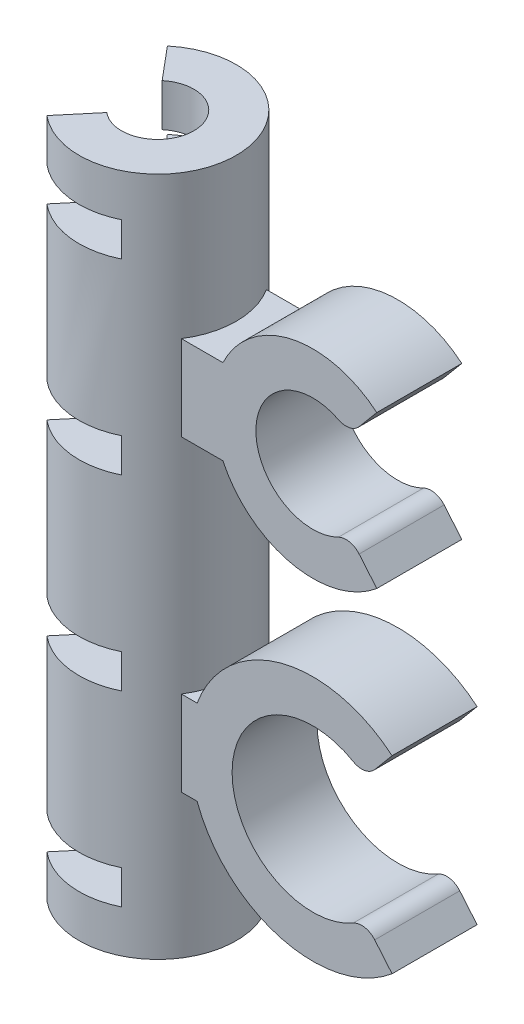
ISO-10303-21;
HEADER;
FILE_DESCRIPTION(('STEP AP214'),'2;1');
FILE_NAME('part.step','',(''),(''),'','','');
FILE_SCHEMA(('AUTOMOTIVE_DESIGN { 1 0 10303 214 1 1 1 1 }'));
ENDSEC;
DATA;
#1=APPLICATION_CONTEXT('core data for automotive mechanical design processes');
#2=APPLICATION_PROTOCOL_DEFINITION('international standard','automotive_design',2000,#1);
#3=PRODUCT_CONTEXT('',#1,'mechanical');
#4=PRODUCT('Part','Part','',(#3));
#5=PRODUCT_RELATED_PRODUCT_CATEGORY('part','',(#4));
#6=PRODUCT_DEFINITION_FORMATION('','',#4);
#7=PRODUCT_DEFINITION_CONTEXT('part definition',#1,'design');
#8=PRODUCT_DEFINITION('design','',#6,#7);
#9=PRODUCT_DEFINITION_SHAPE('','',#8);
#10=(LENGTH_UNIT() NAMED_UNIT(*) SI_UNIT(.MILLI.,.METRE.));
#11=(NAMED_UNIT(*) PLANE_ANGLE_UNIT() SI_UNIT($,.RADIAN.));
#12=(NAMED_UNIT(*) SI_UNIT($,.STERADIAN.) SOLID_ANGLE_UNIT());
#13=UNCERTAINTY_MEASURE_WITH_UNIT(LENGTH_MEASURE(1.E-05),#10,'distance_accuracy_value','');
#14=(GEOMETRIC_REPRESENTATION_CONTEXT(3) GLOBAL_UNCERTAINTY_ASSIGNED_CONTEXT((#13)) GLOBAL_UNIT_ASSIGNED_CONTEXT((#10,
#11,#12)) REPRESENTATION_CONTEXT('',''));
#15=CARTESIAN_POINT('',(0.,0.,0.));
#16=DIRECTION('',(0.,0.,1.));
#17=DIRECTION('',(1.,0.,0.));
#18=AXIS2_PLACEMENT_3D('',#15,#16,#17);
#19=CARTESIAN_POINT('',(0.,40.,0.));
#20=DIRECTION('',(0.,-1.,0.));
#21=DIRECTION('',(0.,0.,-1.));
#22=AXIS2_PLACEMENT_3D('',#19,#20,#21);
#23=CYLINDRICAL_SURFACE('',#22,4.25);
#24=CARTESIAN_POINT('',(0.,31.,0.));
#25=DIRECTION('',(0.,1.,0.));
#26=DIRECTION('',(-1.,0.,0.));
#27=AXIS2_PLACEMENT_3D('',#24,#25,#26);
#28=CIRCLE('',#27,4.25);
#29=CARTESIAN_POINT('',(-2.73184734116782,31.,-3.25568888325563));
#30=VERTEX_POINT('',#29);
#31=CARTESIAN_POINT('',(4.05421461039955,31.,-1.27508583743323));
#32=VERTEX_POINT('',#31);
#33=EDGE_CURVE('E817',#30,#32,#28,.F.);
#34=ORIENTED_EDGE('',*,*,#33,.F.);
#35=DIRECTION('',(0.,-1.,0.));
#36=VECTOR('',#35,1.);
#37=CARTESIAN_POINT('',(-2.73184734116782,40.,-3.25568888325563));
#38=LINE('',#37,#36);
#39=CARTESIAN_POINT('',(-2.73184734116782,13.,-3.25568888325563));
#40=VERTEX_POINT('',#39);
#41=EDGE_CURVE('E730',#30,#40,#38,.T.);
#42=ORIENTED_EDGE('',*,*,#41,.T.);
#43=CARTESIAN_POINT('',(0.,13.,0.));
#44=DIRECTION('',(0.,-1.,0.));
#45=DIRECTION('',(1.,0.,0.));
#46=AXIS2_PLACEMENT_3D('',#43,#44,#45);
#47=CIRCLE('',#46,4.25);
#48=CARTESIAN_POINT('',(4.05421461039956,13.,-1.27508583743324));
#49=VERTEX_POINT('',#48);
#50=EDGE_CURVE('E796',#49,#40,#47,.F.);
#51=ORIENTED_EDGE('',*,*,#50,.F.);
#52=DIRECTION('',(0.,-1.,0.));
#53=VECTOR('',#52,1.);
#54=CARTESIAN_POINT('',(4.05421461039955,40.,-1.27508583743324));
#55=LINE('',#54,#53);
#56=CARTESIAN_POINT('',(4.05421461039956,9.,-1.27508583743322));
#57=VERTEX_POINT('',#56);
#58=EDGE_CURVE('E839',#57,#49,#55,.F.);
#59=ORIENTED_EDGE('',*,*,#58,.F.);
#60=CARTESIAN_POINT('',(0.,9.,0.));
#61=DIRECTION('',(0.,1.,0.));
#62=DIRECTION('',(-1.,0.,0.));
#63=AXIS2_PLACEMENT_3D('',#60,#61,#62);
#64=CIRCLE('',#63,4.25);
#65=CARTESIAN_POINT('',(-2.73184734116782,9.,-3.25568888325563));
#66=VERTEX_POINT('',#65);
#67=EDGE_CURVE('E746',#66,#57,#64,.F.);
#68=ORIENTED_EDGE('',*,*,#67,.F.);
#69=CARTESIAN_POINT('',(-2.73184734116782,-9.,-3.25568888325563));
#70=VERTEX_POINT('',#69);
#71=EDGE_CURVE('E727',#66,#70,#38,.T.);
#72=ORIENTED_EDGE('',*,*,#71,.T.);
#73=CARTESIAN_POINT('',(0.,-9.,0.));
#74=DIRECTION('',(0.,-1.,0.));
#75=DIRECTION('',(1.,0.,0.));
#76=AXIS2_PLACEMENT_3D('',#73,#74,#75);
#77=CIRCLE('',#76,4.25);
#78=CARTESIAN_POINT('',(4.05421461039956,-9.,-1.27508583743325));
#79=VERTEX_POINT('',#78);
#80=EDGE_CURVE('E744',#79,#70,#77,.F.);
#81=ORIENTED_EDGE('',*,*,#80,.F.);
#82=DIRECTION('',(0.,-1.,0.));
#83=VECTOR('',#82,1.);
#84=CARTESIAN_POINT('',(4.05421461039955,40.,-1.27508583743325));
#85=LINE('',#84,#83);
#86=CARTESIAN_POINT('',(4.05421461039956,-13.,-1.27508583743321));
#87=VERTEX_POINT('',#86);
#88=EDGE_CURVE('E833',#87,#79,#85,.F.);
#89=ORIENTED_EDGE('',*,*,#88,.F.);
#90=CARTESIAN_POINT('',(0.,-13.,0.));
#91=DIRECTION('',(0.,1.,0.));
#92=DIRECTION('',(0.,0.,1.));
#93=AXIS2_PLACEMENT_3D('',#90,#91,#92);
#94=CIRCLE('',#93,4.25);
#95=CARTESIAN_POINT('',(-2.73184734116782,-13.,-3.25568888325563));
#96=VERTEX_POINT('',#95);
#97=EDGE_CURVE('E768',#96,#87,#94,.F.);
#98=ORIENTED_EDGE('',*,*,#97,.F.);
#99=CARTESIAN_POINT('',(-2.73184734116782,-31.,-3.25568888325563));
#100=VERTEX_POINT('',#99);
#101=EDGE_CURVE('E725',#96,#100,#38,.T.);
#102=ORIENTED_EDGE('',*,*,#101,.T.);
#103=CARTESIAN_POINT('',(0.,-31.,0.));
#104=DIRECTION('',(0.,-1.,0.));
#105=DIRECTION('',(1.,0.,0.));
#106=AXIS2_PLACEMENT_3D('',#103,#104,#105);
#107=CIRCLE('',#106,4.25);
#108=CARTESIAN_POINT('',(4.05421461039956,-31.,-1.27508583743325));
#109=VERTEX_POINT('',#108);
#110=EDGE_CURVE('E461',#109,#100,#107,.F.);
#111=ORIENTED_EDGE('',*,*,#110,.F.);
#112=DIRECTION('',(0.,-1.,0.));
#113=VECTOR('',#112,1.);
#114=CARTESIAN_POINT('',(4.05421461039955,40.,-1.27508583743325));
#115=LINE('',#114,#113);
#116=CARTESIAN_POINT('',(4.05421461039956,-35.,-1.2750858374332));
#117=VERTEX_POINT('',#116);
#118=EDGE_CURVE('E827',#117,#109,#115,.F.);
#119=ORIENTED_EDGE('',*,*,#118,.F.);
#120=CARTESIAN_POINT('',(0.,-35.,0.));
#121=DIRECTION('',(0.,1.,0.));
#122=DIRECTION('',(0.,0.,1.));
#123=AXIS2_PLACEMENT_3D('',#120,#121,#122);
#124=CIRCLE('',#123,4.25);
#125=CARTESIAN_POINT('',(-2.73184734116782,-35.,-3.25568888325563));
#126=VERTEX_POINT('',#125);
#127=EDGE_CURVE('E723',#126,#117,#124,.F.);
#128=ORIENTED_EDGE('',*,*,#127,.F.);
#129=CARTESIAN_POINT('',(-2.73184734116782,-40.,-3.25568888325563));
#130=VERTEX_POINT('',#129);
#131=EDGE_CURVE('E693',#126,#130,#38,.T.);
#132=ORIENTED_EDGE('',*,*,#131,.T.);
#133=CARTESIAN_POINT('',(0.,-40.,0.));
#134=DIRECTION('',(0.,-1.,0.));
#135=DIRECTION('',(0.,0.,1.));
#136=AXIS2_PLACEMENT_3D('',#133,#134,#135);
#137=CIRCLE('',#136,4.25);
#138=CARTESIAN_POINT('',(-2.73184734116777,-40.,3.25568888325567));
#139=VERTEX_POINT('',#138);
#140=EDGE_CURVE('E678',#130,#139,#137,.T.);
#141=ORIENTED_EDGE('',*,*,#140,.T.);
#142=DIRECTION('',(0.,-1.,0.));
#143=VECTOR('',#142,1.);
#144=CARTESIAN_POINT('',(-2.73184734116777,40.,3.25568888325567));
#145=LINE('',#144,#143);
#146=CARTESIAN_POINT('',(-2.73184734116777,-35.,3.25568888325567));
#147=VERTEX_POINT('',#146);
#148=EDGE_CURVE('E496',#147,#139,#145,.T.);
#149=ORIENTED_EDGE('',*,*,#148,.F.);
#150=CARTESIAN_POINT('',(4.05421461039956,-35.,1.2750858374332));
#151=VERTEX_POINT('',#150);
#152=EDGE_CURVE('E1036',#151,#147,#124,.F.);
#153=ORIENTED_EDGE('',*,*,#152,.F.);
#154=DIRECTION('',(0.,-1.,0.));
#155=VECTOR('',#154,1.);
#156=CARTESIAN_POINT('',(4.05421461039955,40.,1.27508583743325));
#157=LINE('',#156,#155);
#158=CARTESIAN_POINT('',(4.05421461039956,-31.,1.27508583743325));
#159=VERTEX_POINT('',#158);
#160=EDGE_CURVE('E824',#159,#151,#157,.T.);
#161=ORIENTED_EDGE('',*,*,#160,.F.);
#162=CARTESIAN_POINT('',(-2.73184734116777,-31.,3.25568888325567));
#163=VERTEX_POINT('',#162);
#164=EDGE_CURVE('E1049',#163,#159,#107,.F.);
#165=ORIENTED_EDGE('',*,*,#164,.F.);
#166=CARTESIAN_POINT('',(-2.73184734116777,-13.,3.25568888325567));
#167=VERTEX_POINT('',#166);
#168=EDGE_CURVE('E1019',#167,#163,#145,.T.);
#169=ORIENTED_EDGE('',*,*,#168,.F.);
#170=CARTESIAN_POINT('',(4.05421461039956,-13.,1.27508583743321));
#171=VERTEX_POINT('',#170);
#172=EDGE_CURVE('E759',#171,#167,#94,.F.);
#173=ORIENTED_EDGE('',*,*,#172,.F.);
#174=DIRECTION('',(0.,-1.,0.));
#175=VECTOR('',#174,1.);
#176=CARTESIAN_POINT('',(4.05421461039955,40.,1.27508583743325));
#177=LINE('',#176,#175);
#178=CARTESIAN_POINT('',(4.05421461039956,-9.,1.27508583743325));
#179=VERTEX_POINT('',#178);
#180=EDGE_CURVE('E830',#179,#171,#177,.T.);
#181=ORIENTED_EDGE('',*,*,#180,.F.);
#182=CARTESIAN_POINT('',(-2.73184734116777,-9.,3.25568888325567));
#183=VERTEX_POINT('',#182);
#184=EDGE_CURVE('E761',#183,#179,#77,.F.);
#185=ORIENTED_EDGE('',*,*,#184,.F.);
#186=CARTESIAN_POINT('',(-2.73184734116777,9.,3.25568888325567));
#187=VERTEX_POINT('',#186);
#188=EDGE_CURVE('E1014',#187,#183,#145,.T.);
#189=ORIENTED_EDGE('',*,*,#188,.F.);
#190=CARTESIAN_POINT('',(4.05421461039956,9.,1.27508583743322));
#191=VERTEX_POINT('',#190);
#192=EDGE_CURVE('E788',#191,#187,#64,.F.);
#193=ORIENTED_EDGE('',*,*,#192,.F.);
#194=DIRECTION('',(0.,-1.,0.));
#195=VECTOR('',#194,1.);
#196=CARTESIAN_POINT('',(4.05421461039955,40.,1.27508583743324));
#197=LINE('',#196,#195);
#198=CARTESIAN_POINT('',(4.05421461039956,13.,1.27508583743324));
#199=VERTEX_POINT('',#198);
#200=EDGE_CURVE('E836',#199,#191,#197,.T.);
#201=ORIENTED_EDGE('',*,*,#200,.F.);
#202=CARTESIAN_POINT('',(-2.73184734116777,13.,3.25568888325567));
#203=VERTEX_POINT('',#202);
#204=EDGE_CURVE('E799',#203,#199,#47,.F.);
#205=ORIENTED_EDGE('',*,*,#204,.F.);
#206=CARTESIAN_POINT('',(-2.73184734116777,31.,3.25568888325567));
#207=VERTEX_POINT('',#206);
#208=EDGE_CURVE('E503',#207,#203,#145,.T.);
#209=ORIENTED_EDGE('',*,*,#208,.F.);
#210=CARTESIAN_POINT('',(4.05421461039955,31.,1.27508583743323));
#211=VERTEX_POINT('',#210);
#212=EDGE_CURVE('E821',#211,#207,#28,.F.);
#213=ORIENTED_EDGE('',*,*,#212,.F.);
#214=DIRECTION('',(0.,-1.,0.));
#215=VECTOR('',#214,1.);
#216=CARTESIAN_POINT('',(4.05421461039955,40.,1.27508583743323));
#217=LINE('',#216,#215);
#218=CARTESIAN_POINT('',(4.05421461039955,35.,1.27508583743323));
#219=VERTEX_POINT('',#218);
#220=EDGE_CURVE('E842',#219,#211,#217,.T.);
#221=ORIENTED_EDGE('',*,*,#220,.F.);
#222=CARTESIAN_POINT('',(0.,35.,0.));
#223=DIRECTION('',(0.,-1.,0.));
#224=DIRECTION('',(0.,0.,-1.));
#225=AXIS2_PLACEMENT_3D('',#222,#223,#224);
#226=CIRCLE('',#225,4.25);
#227=CARTESIAN_POINT('',(-2.73184734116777,35.,3.25568888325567));
#228=VERTEX_POINT('',#227);
#229=EDGE_CURVE('E810',#228,#219,#226,.F.);
#230=ORIENTED_EDGE('',*,*,#229,.F.);
#231=CARTESIAN_POINT('',(-2.73184734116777,40.,3.25568888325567));
#232=VERTEX_POINT('',#231);
#233=EDGE_CURVE('E498',#232,#228,#145,.T.);
#234=ORIENTED_EDGE('',*,*,#233,.F.);
#235=CARTESIAN_POINT('',(0.,40.,0.));
#236=DIRECTION('',(0.,-1.,0.));
#237=DIRECTION('',(0.,0.,1.));
#238=AXIS2_PLACEMENT_3D('',#235,#236,#237);
#239=CIRCLE('',#238,4.25);
#240=CARTESIAN_POINT('',(-2.73184734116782,40.,-3.25568888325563));
#241=VERTEX_POINT('',#240);
#242=EDGE_CURVE('E679',#241,#232,#239,.T.);
#243=ORIENTED_EDGE('',*,*,#242,.F.);
#244=CARTESIAN_POINT('',(-2.73184734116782,35.,-3.25568888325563));
#245=VERTEX_POINT('',#244);
#246=EDGE_CURVE('E484',#241,#245,#38,.T.);
#247=ORIENTED_EDGE('',*,*,#246,.T.);
#248=CARTESIAN_POINT('',(4.05421461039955,35.,-1.27508583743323));
#249=VERTEX_POINT('',#248);
#250=EDGE_CURVE('E806',#249,#245,#226,.F.);
#251=ORIENTED_EDGE('',*,*,#250,.F.);
#252=DIRECTION('',(0.,-1.,0.));
#253=VECTOR('',#252,1.);
#254=CARTESIAN_POINT('',(4.05421461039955,40.,-1.27508583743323));
#255=LINE('',#254,#253);
#256=EDGE_CURVE('E845',#32,#249,#255,.F.);
#257=ORIENTED_EDGE('',*,*,#256,.F.);
#258=EDGE_LOOP('',(#34,#42,#51,#59,#68,#72,#81,#89,#98,#102,#111,#119,#128,#132,#141,#149,#153,
#161,#165,#169,#173,#181,#185,#189,#193,#201,#205,#209,#213,#221,#230,#234,#243,#247,#251,#257));
#259=FACE_BOUND('',#258,.T.);
#260=ADVANCED_FACE('F89',(#259),#23,.F.);
#261=CARTESIAN_POINT('',(-5.94578538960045,40.,7.08591109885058));
#262=DIRECTION('',(0.766044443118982,0.,0.642787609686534));
#263=DIRECTION('',(0.642787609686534,0.,-0.766044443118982));
#264=AXIS2_PLACEMENT_3D('',#261,#262,#263);
#265=PLANE('',#264);
#266=DIRECTION('',(-0.642787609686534,0.,0.766044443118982));
#267=VECTOR('',#266,1.);
#268=CARTESIAN_POINT('',(-5.94578538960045,31.,7.08591109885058));
#269=LINE('',#268,#267);
#270=CARTESIAN_POINT('',(-5.94578538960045,31.,7.08591109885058));
#271=VERTEX_POINT('',#270);
#272=EDGE_CURVE('E816',#207,#271,#269,.T.);
#273=ORIENTED_EDGE('',*,*,#272,.F.);
#274=ORIENTED_EDGE('',*,*,#208,.T.);
#275=DIRECTION('',(0.642787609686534,0.,-0.766044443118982));
#276=VECTOR('',#275,1.);
#277=CARTESIAN_POINT('',(-5.94578538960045,13.,7.08591109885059));
#278=LINE('',#277,#276);
#279=CARTESIAN_POINT('',(-5.94578538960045,13.,7.08591109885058));
#280=VERTEX_POINT('',#279);
#281=EDGE_CURVE('E794',#280,#203,#278,.T.);
#282=ORIENTED_EDGE('',*,*,#281,.F.);
#283=DIRECTION('',(0.,-1.,0.));
#284=VECTOR('',#283,1.);
#285=CARTESIAN_POINT('',(-5.94578538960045,40.,7.08591109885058));
#286=LINE('',#285,#284);
#287=EDGE_CURVE('E497',#271,#280,#286,.T.);
#288=ORIENTED_EDGE('',*,*,#287,.F.);
#289=EDGE_LOOP('',(#273,#274,#282,#288));
#290=FACE_BOUND('',#289,.T.);
#291=ADVANCED_FACE('F953',(#290),#265,.F.);
#292=DIRECTION('',(0.642787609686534,0.,-0.766044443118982));
#293=VECTOR('',#292,1.);
#294=CARTESIAN_POINT('',(-5.94578538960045,35.,7.08591109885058));
#295=LINE('',#294,#293);
#296=CARTESIAN_POINT('',(-5.94578538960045,35.,7.08591109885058));
#297=VERTEX_POINT('',#296);
#298=EDGE_CURVE('E805',#297,#228,#295,.T.);
#299=ORIENTED_EDGE('',*,*,#298,.F.);
#300=CARTESIAN_POINT('',(-5.94578538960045,40.,7.08591109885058));
#301=VERTEX_POINT('',#300);
#302=EDGE_CURVE('E492',#301,#297,#286,.T.);
#303=ORIENTED_EDGE('',*,*,#302,.F.);
#304=DIRECTION('',(-0.642787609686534,0.,0.766044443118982));
#305=VECTOR('',#304,1.);
#306=CARTESIAN_POINT('',(-5.94578538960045,40.,7.08591109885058));
#307=LINE('',#306,#305);
#308=EDGE_CURVE('E683',#232,#301,#307,.T.);
#309=ORIENTED_EDGE('',*,*,#308,.F.);
#310=ORIENTED_EDGE('',*,*,#233,.T.);
#311=EDGE_LOOP('',(#299,#303,#309,#310));
#312=FACE_BOUND('',#311,.T.);
#313=ADVANCED_FACE('F958',(#312),#265,.F.);
#314=DIRECTION('',(-0.642787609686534,0.,0.766044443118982));
#315=VECTOR('',#314,1.);
#316=CARTESIAN_POINT('',(-5.94578538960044,9.,7.08591109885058));
#317=LINE('',#316,#315);
#318=CARTESIAN_POINT('',(-5.94578538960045,9.,7.08591109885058));
#319=VERTEX_POINT('',#318);
#320=EDGE_CURVE('E785',#187,#319,#317,.T.);
#321=ORIENTED_EDGE('',*,*,#320,.F.);
#322=ORIENTED_EDGE('',*,*,#188,.T.);
#323=DIRECTION('',(0.642787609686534,0.,-0.766044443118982));
#324=VECTOR('',#323,1.);
#325=CARTESIAN_POINT('',(-5.94578538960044,-9.,7.08591109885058));
#326=LINE('',#325,#324);
#327=CARTESIAN_POINT('',(-5.94578538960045,-9.,7.08591109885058));
#328=VERTEX_POINT('',#327);
#329=EDGE_CURVE('E772',#328,#183,#326,.T.);
#330=ORIENTED_EDGE('',*,*,#329,.F.);
#331=EDGE_CURVE('E1016',#319,#328,#286,.T.);
#332=ORIENTED_EDGE('',*,*,#331,.F.);
#333=EDGE_LOOP('',(#321,#322,#330,#332));
#334=FACE_BOUND('',#333,.T.);
#335=ADVANCED_FACE('F1013',(#334),#265,.F.);
#336=DIRECTION('',(-0.642787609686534,0.,0.766044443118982));
#337=VECTOR('',#336,1.);
#338=CARTESIAN_POINT('',(-5.94578538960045,-13.,7.08591109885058));
#339=LINE('',#338,#337);
#340=CARTESIAN_POINT('',(-5.94578538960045,-13.,7.08591109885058));
#341=VERTEX_POINT('',#340);
#342=EDGE_CURVE('E766',#167,#341,#339,.T.);
#343=ORIENTED_EDGE('',*,*,#342,.F.);
#344=ORIENTED_EDGE('',*,*,#168,.T.);
#345=DIRECTION('',(0.642787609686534,0.,-0.766044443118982));
#346=VECTOR('',#345,1.);
#347=CARTESIAN_POINT('',(-5.94578538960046,-31.,7.0859110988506));
#348=LINE('',#347,#346);
#349=CARTESIAN_POINT('',(-5.94578538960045,-31.,7.08591109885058));
#350=VERTEX_POINT('',#349);
#351=EDGE_CURVE('E1046',#350,#163,#348,.T.);
#352=ORIENTED_EDGE('',*,*,#351,.F.);
#353=EDGE_CURVE('E1066',#341,#350,#286,.T.);
#354=ORIENTED_EDGE('',*,*,#353,.F.);
#355=EDGE_LOOP('',(#343,#344,#352,#354));
#356=FACE_BOUND('',#355,.T.);
#357=ADVANCED_FACE('F1067',(#356),#265,.F.);
#358=DIRECTION('',(-0.642787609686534,0.,0.766044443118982));
#359=VECTOR('',#358,1.);
#360=CARTESIAN_POINT('',(-5.94578538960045,-35.,7.08591109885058));
#361=LINE('',#360,#359);
#362=CARTESIAN_POINT('',(-5.94578538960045,-35.,7.08591109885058));
#363=VERTEX_POINT('',#362);
#364=EDGE_CURVE('E1033',#147,#363,#361,.T.);
#365=ORIENTED_EDGE('',*,*,#364,.F.);
#366=ORIENTED_EDGE('',*,*,#148,.T.);
#367=DIRECTION('',(-0.642787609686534,0.,0.766044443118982));
#368=VECTOR('',#367,1.);
#369=CARTESIAN_POINT('',(-5.94578538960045,-40.,7.08591109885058));
#370=LINE('',#369,#368);
#371=CARTESIAN_POINT('',(-5.94578538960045,-40.,7.08591109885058));
#372=VERTEX_POINT('',#371);
#373=EDGE_CURVE('E697',#139,#372,#370,.T.);
#374=ORIENTED_EDGE('',*,*,#373,.T.);
#375=EDGE_CURVE('E490',#363,#372,#286,.T.);
#376=ORIENTED_EDGE('',*,*,#375,.F.);
#377=EDGE_LOOP('',(#365,#366,#374,#376));
#378=FACE_BOUND('',#377,.T.);
#379=ADVANCED_FACE('F961',(#378),#265,.F.);
#380=CARTESIAN_POINT('',(0.,40.,0.));
#381=DIRECTION('',(0.,-1.,0.));
#382=DIRECTION('',(0.,0.,-1.));
#383=AXIS2_PLACEMENT_3D('',#380,#381,#382);
#384=CYLINDRICAL_SURFACE('',#383,9.25);
#385=CARTESIAN_POINT('',(0.,13.1,0.));
#386=DIRECTION('',(0.,1.,0.));
#387=DIRECTION('',(-1.,0.,0.));
#388=AXIS2_PLACEMENT_3D('',#385,#386,#387);
#389=CIRCLE('',#388,9.25);
#390=CARTESIAN_POINT('',(7.78219120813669,13.1,5.));
#391=VERTEX_POINT('',#390);
#392=CARTESIAN_POINT('',(7.78219120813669,13.1,-5.));
#393=VERTEX_POINT('',#392);
#394=EDGE_CURVE('E510',#391,#393,#389,.T.);
#395=ORIENTED_EDGE('',*,*,#394,.F.);
#396=DIRECTION('',(0.,-1.,0.));
#397=VECTOR('',#396,1.);
#398=CARTESIAN_POINT('',(7.78219120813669,40.,5.));
#399=LINE('',#398,#397);
#400=CARTESIAN_POINT('',(7.78219120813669,23.1,5.));
#401=VERTEX_POINT('',#400);
#402=EDGE_CURVE('E514',#391,#401,#399,.F.);
#403=ORIENTED_EDGE('',*,*,#402,.T.);
#404=CARTESIAN_POINT('',(0.,23.1,0.));
#405=DIRECTION('',(0.,1.,0.));
#406=DIRECTION('',(-1.,0.,0.));
#407=AXIS2_PLACEMENT_3D('',#404,#405,#406);
#408=CIRCLE('',#407,9.25);
#409=CARTESIAN_POINT('',(7.78219120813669,23.1,-5.));
#410=VERTEX_POINT('',#409);
#411=EDGE_CURVE('E507',#401,#410,#408,.T.);
#412=ORIENTED_EDGE('',*,*,#411,.T.);
#413=DIRECTION('',(0.,-1.,0.));
#414=VECTOR('',#413,1.);
#415=CARTESIAN_POINT('',(7.78219120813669,40.,-5.));
#416=LINE('',#415,#414);
#417=EDGE_CURVE('E502',#393,#410,#416,.F.);
#418=ORIENTED_EDGE('',*,*,#417,.F.);
#419=EDGE_LOOP('',(#395,#403,#412,#418));
#420=FACE_BOUND('',#419,.T.);
#421=CARTESIAN_POINT('',(0.,-23.1,0.));
#422=DIRECTION('',(0.,1.,0.));
#423=DIRECTION('',(0.,0.,1.));
#424=AXIS2_PLACEMENT_3D('',#421,#422,#423);
#425=CIRCLE('',#424,9.25);
#426=CARTESIAN_POINT('',(7.78219120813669,-23.1,5.));
#427=VERTEX_POINT('',#426);
#428=CARTESIAN_POINT('',(7.78219120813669,-23.1,-5.));
#429=VERTEX_POINT('',#428);
#430=EDGE_CURVE('E524',#427,#429,#425,.T.);
#431=ORIENTED_EDGE('',*,*,#430,.F.);
#432=DIRECTION('',(0.,-1.,0.));
#433=VECTOR('',#432,1.);
#434=CARTESIAN_POINT('',(7.78219120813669,40.,5.));
#435=LINE('',#434,#433);
#436=CARTESIAN_POINT('',(7.78219120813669,-13.1,5.));
#437=VERTEX_POINT('',#436);
#438=EDGE_CURVE('E528',#427,#437,#435,.F.);
#439=ORIENTED_EDGE('',*,*,#438,.T.);
#440=CARTESIAN_POINT('',(0.,-13.1,0.));
#441=DIRECTION('',(0.,1.,0.));
#442=DIRECTION('',(-1.,0.,0.));
#443=AXIS2_PLACEMENT_3D('',#440,#441,#442);
#444=CIRCLE('',#443,9.25);
#445=CARTESIAN_POINT('',(7.78219120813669,-13.1,-5.));
#446=VERTEX_POINT('',#445);
#447=EDGE_CURVE('E521',#437,#446,#444,.T.);
#448=ORIENTED_EDGE('',*,*,#447,.T.);
#449=DIRECTION('',(0.,-1.,0.));
#450=VECTOR('',#449,1.);
#451=CARTESIAN_POINT('',(7.78219120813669,40.,-5.));
#452=LINE('',#451,#450);
#453=EDGE_CURVE('E517',#429,#446,#452,.F.);
#454=ORIENTED_EDGE('',*,*,#453,.F.);
#455=EDGE_LOOP('',(#431,#439,#448,#454));
#456=FACE_BOUND('',#455,.T.);
#457=CARTESIAN_POINT('',(0.,31.,0.));
#458=DIRECTION('',(0.,1.,0.));
#459=DIRECTION('',(-1.,0.,0.));
#460=AXIS2_PLACEMENT_3D('',#457,#458,#459);
#461=CIRCLE('',#460,9.25);
#462=CARTESIAN_POINT('',(4.05421461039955,31.,-8.31419532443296));
#463=VERTEX_POINT('',#462);
#464=CARTESIAN_POINT('',(-5.94578538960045,31.,-7.08591109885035));
#465=VERTEX_POINT('',#464);
#466=EDGE_CURVE('E818',#463,#465,#461,.T.);
#467=ORIENTED_EDGE('',*,*,#466,.F.);
#468=DIRECTION('',(0.,-1.,0.));
#469=VECTOR('',#468,1.);
#470=CARTESIAN_POINT('',(4.05421461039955,40.,-8.31419532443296));
#471=LINE('',#470,#469);
#472=CARTESIAN_POINT('',(4.05421461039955,35.,-8.31419532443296));
#473=VERTEX_POINT('',#472);
#474=EDGE_CURVE('E573',#473,#463,#471,.T.);
#475=ORIENTED_EDGE('',*,*,#474,.F.);
#476=CARTESIAN_POINT('',(0.,35.,0.));
#477=DIRECTION('',(0.,-1.,0.));
#478=DIRECTION('',(0.,0.,-1.));
#479=AXIS2_PLACEMENT_3D('',#476,#477,#478);
#480=CIRCLE('',#479,9.25);
#481=CARTESIAN_POINT('',(-5.94578538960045,35.,-7.08591109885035));
#482=VERTEX_POINT('',#481);
#483=EDGE_CURVE('E807',#482,#473,#480,.T.);
#484=ORIENTED_EDGE('',*,*,#483,.F.);
#485=DIRECTION('',(0.,-1.,0.));
#486=VECTOR('',#485,1.);
#487=CARTESIAN_POINT('',(-5.94578538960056,40.,-7.08591109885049));
#488=LINE('',#487,#486);
#489=CARTESIAN_POINT('',(-5.94578538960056,40.,-7.08591109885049));
#490=VERTEX_POINT('',#489);
#491=EDGE_CURVE('E485',#490,#482,#488,.T.);
#492=ORIENTED_EDGE('',*,*,#491,.F.);
#493=CARTESIAN_POINT('',(0.,40.,0.));
#494=DIRECTION('',(0.,1.,0.));
#495=DIRECTION('',(0.,0.,1.));
#496=AXIS2_PLACEMENT_3D('',#493,#494,#495);
#497=CIRCLE('',#496,9.25);
#498=EDGE_CURVE('E687',#301,#490,#497,.T.);
#499=ORIENTED_EDGE('',*,*,#498,.F.);
#500=ORIENTED_EDGE('',*,*,#302,.T.);
#501=CARTESIAN_POINT('',(4.05421461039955,35.,8.31419532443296));
#502=VERTEX_POINT('',#501);
#503=EDGE_CURVE('E802',#502,#297,#480,.T.);
#504=ORIENTED_EDGE('',*,*,#503,.F.);
#505=DIRECTION('',(0.,-1.,0.));
#506=VECTOR('',#505,1.);
#507=CARTESIAN_POINT('',(4.05421461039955,40.,8.31419532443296));
#508=LINE('',#507,#506);
#509=CARTESIAN_POINT('',(4.05421461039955,31.,8.31419532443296));
#510=VERTEX_POINT('',#509);
#511=EDGE_CURVE('E570',#510,#502,#508,.F.);
#512=ORIENTED_EDGE('',*,*,#511,.F.);
#513=EDGE_CURVE('E813',#271,#510,#461,.T.);
#514=ORIENTED_EDGE('',*,*,#513,.F.);
#515=ORIENTED_EDGE('',*,*,#287,.T.);
#516=CARTESIAN_POINT('',(0.,13.,0.));
#517=DIRECTION('',(0.,-1.,0.));
#518=DIRECTION('',(1.,0.,0.));
#519=AXIS2_PLACEMENT_3D('',#516,#517,#518);
#520=CIRCLE('',#519,9.25);
#521=CARTESIAN_POINT('',(4.05421461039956,13.,8.31419532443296));
#522=VERTEX_POINT('',#521);
#523=EDGE_CURVE('E791',#522,#280,#520,.T.);
#524=ORIENTED_EDGE('',*,*,#523,.F.);
#525=DIRECTION('',(0.,-1.,0.));
#526=VECTOR('',#525,1.);
#527=CARTESIAN_POINT('',(4.05421461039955,40.,8.31419532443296));
#528=LINE('',#527,#526);
#529=CARTESIAN_POINT('',(4.05421461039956,9.,8.31419532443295));
#530=VERTEX_POINT('',#529);
#531=EDGE_CURVE('E564',#530,#522,#528,.F.);
#532=ORIENTED_EDGE('',*,*,#531,.F.);
#533=CARTESIAN_POINT('',(0.,9.,0.));
#534=DIRECTION('',(0.,1.,0.));
#535=DIRECTION('',(-1.,0.,0.));
#536=AXIS2_PLACEMENT_3D('',#533,#534,#535);
#537=CIRCLE('',#536,9.25);
#538=EDGE_CURVE('E780',#319,#530,#537,.T.);
#539=ORIENTED_EDGE('',*,*,#538,.F.);
#540=ORIENTED_EDGE('',*,*,#331,.T.);
#541=CARTESIAN_POINT('',(0.,-9.,0.));
#542=DIRECTION('',(0.,-1.,0.));
#543=DIRECTION('',(1.,0.,0.));
#544=AXIS2_PLACEMENT_3D('',#541,#542,#543);
#545=CIRCLE('',#544,9.25);
#546=CARTESIAN_POINT('',(4.05421461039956,-9.,8.31419532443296));
#547=VERTEX_POINT('',#546);
#548=EDGE_CURVE('E764',#547,#328,#545,.T.);
#549=ORIENTED_EDGE('',*,*,#548,.F.);
#550=DIRECTION('',(0.,-1.,0.));
#551=VECTOR('',#550,1.);
#552=CARTESIAN_POINT('',(4.05421461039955,40.,8.31419532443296));
#553=LINE('',#552,#551);
#554=CARTESIAN_POINT('',(4.05421461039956,-13.,8.31419532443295));
#555=VERTEX_POINT('',#554);
#556=EDGE_CURVE('E561',#555,#547,#553,.F.);
#557=ORIENTED_EDGE('',*,*,#556,.F.);
#558=CARTESIAN_POINT('',(0.,-13.,0.));
#559=DIRECTION('',(0.,1.,0.));
#560=DIRECTION('',(0.,0.,1.));
#561=AXIS2_PLACEMENT_3D('',#558,#559,#560);
#562=CIRCLE('',#561,9.25);
#563=EDGE_CURVE('E1052',#341,#555,#562,.T.);
#564=ORIENTED_EDGE('',*,*,#563,.F.);
#565=ORIENTED_EDGE('',*,*,#353,.T.);
#566=CARTESIAN_POINT('',(0.,-31.,0.));
#567=DIRECTION('',(0.,-1.,0.));
#568=DIRECTION('',(1.,0.,0.));
#569=AXIS2_PLACEMENT_3D('',#566,#567,#568);
#570=CIRCLE('',#569,9.25);
#571=CARTESIAN_POINT('',(4.05421461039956,-31.,8.31419532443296));
#572=VERTEX_POINT('',#571);
#573=EDGE_CURVE('E460',#572,#350,#570,.T.);
#574=ORIENTED_EDGE('',*,*,#573,.F.);
#575=DIRECTION('',(0.,-1.,0.));
#576=VECTOR('',#575,1.);
#577=CARTESIAN_POINT('',(4.05421461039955,40.,8.31419532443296));
#578=LINE('',#577,#576);
#579=CARTESIAN_POINT('',(4.05421461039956,-35.,8.31419532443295));
#580=VERTEX_POINT('',#579);
#581=EDGE_CURVE('E555',#580,#572,#578,.F.);
#582=ORIENTED_EDGE('',*,*,#581,.F.);
#583=CARTESIAN_POINT('',(0.,-35.,0.));
#584=DIRECTION('',(0.,1.,0.));
#585=DIRECTION('',(0.,0.,1.));
#586=AXIS2_PLACEMENT_3D('',#583,#584,#585);
#587=CIRCLE('',#586,9.25);
#588=EDGE_CURVE('E1037',#363,#580,#587,.T.);
#589=ORIENTED_EDGE('',*,*,#588,.F.);
#590=ORIENTED_EDGE('',*,*,#375,.T.);
#591=CARTESIAN_POINT('',(0.,-40.,0.));
#592=DIRECTION('',(0.,1.,0.));
#593=DIRECTION('',(0.,0.,1.));
#594=AXIS2_PLACEMENT_3D('',#591,#592,#593);
#595=CIRCLE('',#594,9.25);
#596=CARTESIAN_POINT('',(-5.94578538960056,-40.,-7.08591109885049));
#597=VERTEX_POINT('',#596);
#598=EDGE_CURVE('E701',#372,#597,#595,.T.);
#599=ORIENTED_EDGE('',*,*,#598,.T.);
#600=CARTESIAN_POINT('',(-5.94578538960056,-35.,-7.08591109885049));
#601=VERTEX_POINT('',#600);
#602=EDGE_CURVE('E478',#601,#597,#488,.T.);
#603=ORIENTED_EDGE('',*,*,#602,.F.);
#604=CARTESIAN_POINT('',(4.05421461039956,-35.,-8.31419532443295));
#605=VERTEX_POINT('',#604);
#606=EDGE_CURVE('E1043',#605,#601,#587,.T.);
#607=ORIENTED_EDGE('',*,*,#606,.F.);
#608=DIRECTION('',(0.,-1.,0.));
#609=VECTOR('',#608,1.);
#610=CARTESIAN_POINT('',(4.05421461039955,40.,-8.31419532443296));
#611=LINE('',#610,#609);
#612=CARTESIAN_POINT('',(4.05421461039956,-31.,-8.31419532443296));
#613=VERTEX_POINT('',#612);
#614=EDGE_CURVE('E455',#613,#605,#611,.T.);
#615=ORIENTED_EDGE('',*,*,#614,.F.);
#616=CARTESIAN_POINT('',(-5.94578538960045,-31.,-7.08591109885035));
#617=VERTEX_POINT('',#616);
#618=EDGE_CURVE('E447',#617,#613,#570,.T.);
#619=ORIENTED_EDGE('',*,*,#618,.F.);
#620=CARTESIAN_POINT('',(-5.94578538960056,-13.,-7.08591109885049));
#621=VERTEX_POINT('',#620);
#622=EDGE_CURVE('E453',#621,#617,#488,.T.);
#623=ORIENTED_EDGE('',*,*,#622,.F.);
#624=CARTESIAN_POINT('',(4.05421461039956,-13.,-8.31419532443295));
#625=VERTEX_POINT('',#624);
#626=EDGE_CURVE('E1054',#625,#621,#562,.T.);
#627=ORIENTED_EDGE('',*,*,#626,.F.);
#628=DIRECTION('',(0.,-1.,0.));
#629=VECTOR('',#628,1.);
#630=CARTESIAN_POINT('',(4.05421461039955,40.,-8.31419532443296));
#631=LINE('',#630,#629);
#632=CARTESIAN_POINT('',(4.05421461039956,-9.,-8.31419532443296));
#633=VERTEX_POINT('',#632);
#634=EDGE_CURVE('E558',#633,#625,#631,.T.);
#635=ORIENTED_EDGE('',*,*,#634,.F.);
#636=CARTESIAN_POINT('',(-5.94578538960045,-9.,-7.08591109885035));
#637=VERTEX_POINT('',#636);
#638=EDGE_CURVE('E755',#637,#633,#545,.T.);
#639=ORIENTED_EDGE('',*,*,#638,.F.);
#640=CARTESIAN_POINT('',(-5.94578538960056,9.,-7.08591109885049));
#641=VERTEX_POINT('',#640);
#642=EDGE_CURVE('E477',#641,#637,#488,.T.);
#643=ORIENTED_EDGE('',*,*,#642,.F.);
#644=CARTESIAN_POINT('',(4.05421461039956,9.,-8.31419532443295));
#645=VERTEX_POINT('',#644);
#646=EDGE_CURVE('E771',#645,#641,#537,.T.);
#647=ORIENTED_EDGE('',*,*,#646,.F.);
#648=DIRECTION('',(0.,-1.,0.));
#649=VECTOR('',#648,1.);
#650=CARTESIAN_POINT('',(4.05421461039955,40.,-8.31419532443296));
#651=LINE('',#650,#649);
#652=CARTESIAN_POINT('',(4.05421461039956,13.,-8.31419532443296));
#653=VERTEX_POINT('',#652);
#654=EDGE_CURVE('E567',#653,#645,#651,.T.);
#655=ORIENTED_EDGE('',*,*,#654,.F.);
#656=CARTESIAN_POINT('',(-5.94578538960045,13.,-7.08591109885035));
#657=VERTEX_POINT('',#656);
#658=EDGE_CURVE('E795',#657,#653,#520,.T.);
#659=ORIENTED_EDGE('',*,*,#658,.F.);
#660=EDGE_CURVE('E483',#465,#657,#488,.T.);
#661=ORIENTED_EDGE('',*,*,#660,.F.);
#662=EDGE_LOOP('',(#467,#475,#484,#492,#499,#500,#504,#512,#514,#515,#524,#532,#539,#540,#549,
#557,#564,#565,#574,#582,#589,#590,#599,#603,#607,#615,#619,#623,#627,#635,#639,#643,#647,#655,
#659,#661));
#663=FACE_BOUND('',#662,.T.);
#664=ADVANCED_FACE('F450',(#420,#456,#663),#384,.T.);
#665=CARTESIAN_POINT('',(-2.73184734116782,40.,-3.25568888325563));
#666=DIRECTION('',(0.766044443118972,0.,-0.642787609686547));
#667=DIRECTION('',(-0.642787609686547,0.,-0.766044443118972));
#668=AXIS2_PLACEMENT_3D('',#665,#666,#667);
#669=PLANE('',#668);
#670=DIRECTION('',(0.642787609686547,0.,0.766044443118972));
#671=VECTOR('',#670,1.);
#672=CARTESIAN_POINT('',(-2.73184734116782,31.,-3.25568888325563));
#673=LINE('',#672,#671);
#674=EDGE_CURVE('E550',#465,#30,#673,.T.);
#675=ORIENTED_EDGE('',*,*,#674,.F.);
#676=ORIENTED_EDGE('',*,*,#660,.T.);
#677=DIRECTION('',(-0.642787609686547,0.,-0.766044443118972));
#678=VECTOR('',#677,1.);
#679=CARTESIAN_POINT('',(-2.73184734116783,13.,-3.25568888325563));
#680=LINE('',#679,#678);
#681=EDGE_CURVE('E542',#40,#657,#680,.T.);
#682=ORIENTED_EDGE('',*,*,#681,.F.);
#683=ORIENTED_EDGE('',*,*,#41,.F.);
#684=EDGE_LOOP('',(#675,#676,#682,#683));
#685=FACE_BOUND('',#684,.T.);
#686=ADVANCED_FACE('F1231',(#685),#669,.F.);
#687=DIRECTION('',(-0.642787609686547,0.,-0.766044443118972));
#688=VECTOR('',#687,1.);
#689=CARTESIAN_POINT('',(-2.73184734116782,35.,-3.25568888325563));
#690=LINE('',#689,#688);
#691=EDGE_CURVE('E546',#245,#482,#690,.T.);
#692=ORIENTED_EDGE('',*,*,#691,.F.);
#693=ORIENTED_EDGE('',*,*,#246,.F.);
#694=DIRECTION('',(0.642787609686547,0.,0.766044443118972));
#695=VECTOR('',#694,1.);
#696=CARTESIAN_POINT('',(-2.73184734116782,40.,-3.25568888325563));
#697=LINE('',#696,#695);
#698=EDGE_CURVE('E690',#490,#241,#697,.T.);
#699=ORIENTED_EDGE('',*,*,#698,.F.);
#700=ORIENTED_EDGE('',*,*,#491,.T.);
#701=EDGE_LOOP('',(#692,#693,#699,#700));
#702=FACE_BOUND('',#701,.T.);
#703=ADVANCED_FACE('F1225',(#702),#669,.F.);
#704=DIRECTION('',(0.642787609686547,0.,0.766044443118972));
#705=VECTOR('',#704,1.);
#706=CARTESIAN_POINT('',(-2.73184734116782,9.,-3.25568888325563));
#707=LINE('',#706,#705);
#708=EDGE_CURVE('E539',#641,#66,#707,.T.);
#709=ORIENTED_EDGE('',*,*,#708,.F.);
#710=ORIENTED_EDGE('',*,*,#642,.T.);
#711=DIRECTION('',(-0.642787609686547,0.,-0.766044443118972));
#712=VECTOR('',#711,1.);
#713=CARTESIAN_POINT('',(-2.73184734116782,-9.,-3.25568888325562));
#714=LINE('',#713,#712);
#715=EDGE_CURVE('E535',#70,#637,#714,.T.);
#716=ORIENTED_EDGE('',*,*,#715,.F.);
#717=ORIENTED_EDGE('',*,*,#71,.F.);
#718=EDGE_LOOP('',(#709,#710,#716,#717));
#719=FACE_BOUND('',#718,.T.);
#720=ADVANCED_FACE('F750',(#719),#669,.F.);
#721=DIRECTION('',(0.642787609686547,0.,0.766044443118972));
#722=VECTOR('',#721,1.);
#723=CARTESIAN_POINT('',(-2.73184734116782,-13.,-3.25568888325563));
#724=LINE('',#723,#722);
#725=EDGE_CURVE('E471',#621,#96,#724,.T.);
#726=ORIENTED_EDGE('',*,*,#725,.F.);
#727=ORIENTED_EDGE('',*,*,#622,.T.);
#728=DIRECTION('',(-0.642787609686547,0.,-0.766044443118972));
#729=VECTOR('',#728,1.);
#730=CARTESIAN_POINT('',(-2.73184734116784,-31.,-3.25568888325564));
#731=LINE('',#730,#729);
#732=EDGE_CURVE('E464',#100,#617,#731,.T.);
#733=ORIENTED_EDGE('',*,*,#732,.F.);
#734=ORIENTED_EDGE('',*,*,#101,.F.);
#735=EDGE_LOOP('',(#726,#727,#733,#734));
#736=FACE_BOUND('',#735,.T.);
#737=ADVANCED_FACE('F475',(#736),#669,.F.);
#738=DIRECTION('',(0.642787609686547,0.,0.766044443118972));
#739=VECTOR('',#738,1.);
#740=CARTESIAN_POINT('',(-2.73184734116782,-35.,-3.25568888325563));
#741=LINE('',#740,#739);
#742=EDGE_CURVE('E472',#601,#126,#741,.T.);
#743=ORIENTED_EDGE('',*,*,#742,.F.);
#744=ORIENTED_EDGE('',*,*,#602,.T.);
#745=DIRECTION('',(0.642787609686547,0.,0.766044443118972));
#746=VECTOR('',#745,1.);
#747=CARTESIAN_POINT('',(-2.73184734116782,-40.,-3.25568888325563));
#748=LINE('',#747,#746);
#749=EDGE_CURVE('E684',#597,#130,#748,.T.);
#750=ORIENTED_EDGE('',*,*,#749,.T.);
#751=ORIENTED_EDGE('',*,*,#131,.F.);
#752=EDGE_LOOP('',(#743,#744,#750,#751));
#753=FACE_BOUND('',#752,.T.);
#754=ADVANCED_FACE('F711',(#753),#669,.F.);
#755=CARTESIAN_POINT('',(0.,40.,0.));
#756=DIRECTION('',(0.,1.,0.));
#757=DIRECTION('',(0.,0.,1.));
#758=AXIS2_PLACEMENT_3D('',#755,#756,#757);
#759=PLANE('',#758);
#760=ORIENTED_EDGE('',*,*,#242,.T.);
#761=ORIENTED_EDGE('',*,*,#308,.T.);
#762=ORIENTED_EDGE('',*,*,#498,.T.);
#763=ORIENTED_EDGE('',*,*,#698,.T.);
#764=EDGE_LOOP('',(#760,#761,#762,#763));
#765=FACE_BOUND('',#764,.T.);
#766=ADVANCED_FACE('F1220',(#765),#759,.T.);
#767=CARTESIAN_POINT('',(0.,-40.,0.));
#768=DIRECTION('',(0.,1.,0.));
#769=DIRECTION('',(0.,0.,1.));
#770=AXIS2_PLACEMENT_3D('',#767,#768,#769);
#771=PLANE('',#770);
#772=ORIENTED_EDGE('',*,*,#140,.F.);
#773=ORIENTED_EDGE('',*,*,#749,.F.);
#774=ORIENTED_EDGE('',*,*,#598,.F.);
#775=ORIENTED_EDGE('',*,*,#373,.F.);
#776=EDGE_LOOP('',(#772,#773,#774,#775));
#777=FACE_BOUND('',#776,.T.);
#778=ADVANCED_FACE('F716',(#777),#771,.F.);
#779=CARTESIAN_POINT('',(0.,0.,5.));
#780=DIRECTION('',(0.,0.,1.));
#781=DIRECTION('',(1.,0.,0.));
#782=AXIS2_PLACEMENT_3D('',#779,#780,#781);
#783=PLANE('',#782);
#784=DIRECTION('',(-0.642787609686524,0.766044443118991,0.));
#785=VECTOR('',#784,1.);
#786=CARTESIAN_POINT('',(22.5561702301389,18.9268741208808,5.));
#787=LINE('',#786,#785);
#788=CARTESIAN_POINT('',(30.7706150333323,9.13728001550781,5.));
#789=VERTEX_POINT('',#788);
#790=CARTESIAN_POINT('',(28.6924793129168,11.6139057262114,5.));
#791=VERTEX_POINT('',#790);
#792=EDGE_CURVE('E623',#789,#791,#787,.T.);
#793=ORIENTED_EDGE('',*,*,#792,.T.);
#794=CARTESIAN_POINT('',(27.1603904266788,10.3283305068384,5.));
#795=DIRECTION('',(0.,0.,1.));
#796=DIRECTION('',(1.,0.,0.));
#797=AXIS2_PLACEMENT_3D('',#794,#795,#796);
#798=CIRCLE('',#797,2.);
#799=CARTESIAN_POINT('',(26.2614500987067,12.1149211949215,5.));
#800=VERTEX_POINT('',#799);
#801=EDGE_CURVE('E98',#791,#800,#798,.T.);
#802=ORIENTED_EDGE('',*,*,#801,.T.);
#803=CARTESIAN_POINT('',(23.25,18.1,5.));
#804=DIRECTION('',(0.,0.,1.));
#805=DIRECTION('',(1.,0.,0.));
#806=AXIS2_PLACEMENT_3D('',#803,#804,#805);
#807=CIRCLE('',#806,6.7);
#808=CARTESIAN_POINT('',(26.2614500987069,24.0850788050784,5.));
#809=VERTEX_POINT('',#808);
#810=EDGE_CURVE('E622',#809,#800,#807,.T.);
#811=ORIENTED_EDGE('',*,*,#810,.F.);
#812=CARTESIAN_POINT('',(27.1603904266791,25.8716694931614,5.));
#813=DIRECTION('',(0.,0.,1.));
#814=DIRECTION('',(1.,0.,0.));
#815=AXIS2_PLACEMENT_3D('',#812,#813,#814);
#816=CIRCLE('',#815,2.);
#817=CARTESIAN_POINT('',(28.6924793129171,24.5860942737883,5.));
#818=VERTEX_POINT('',#817);
#819=EDGE_CURVE('E105',#809,#818,#816,.T.);
#820=ORIENTED_EDGE('',*,*,#819,.T.);
#821=DIRECTION('',(-0.642787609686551,-0.766044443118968,0.));
#822=VECTOR('',#821,1.);
#823=CARTESIAN_POINT('',(4.7311499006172,-3.96990613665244,5.));
#824=LINE('',#823,#822);
#825=CARTESIAN_POINT('',(30.7706150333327,27.0627199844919,5.));
#826=VERTEX_POINT('',#825);
#827=EDGE_CURVE('E632',#826,#818,#824,.T.);
#828=ORIENTED_EDGE('',*,*,#827,.F.);
#829=CARTESIAN_POINT('',(23.25,18.1,5.));
#830=DIRECTION('',(0.,0.,1.));
#831=DIRECTION('',(1.,0.,0.));
#832=AXIS2_PLACEMENT_3D('',#829,#830,#831);
#833=CIRCLE('',#832,11.7);
#834=CARTESIAN_POINT('',(12.6721930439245,23.1,5.));
#835=VERTEX_POINT('',#834);
#836=EDGE_CURVE('E912',#826,#835,#833,.T.);
#837=ORIENTED_EDGE('',*,*,#836,.T.);
#838=DIRECTION('',(1.,0.,0.));
#839=VECTOR('',#838,1.);
#840=CARTESIAN_POINT('',(0.,23.1,5.));
#841=LINE('',#840,#839);
#842=EDGE_CURVE('E669',#401,#835,#841,.T.);
#843=ORIENTED_EDGE('',*,*,#842,.F.);
#844=ORIENTED_EDGE('',*,*,#402,.F.);
#845=DIRECTION('',(1.,0.,0.));
#846=VECTOR('',#845,1.);
#847=CARTESIAN_POINT('',(0.,13.1,5.));
#848=LINE('',#847,#846);
#849=CARTESIAN_POINT('',(12.6721930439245,13.1,5.));
#850=VERTEX_POINT('',#849);
#851=EDGE_CURVE('E663',#391,#850,#848,.T.);
#852=ORIENTED_EDGE('',*,*,#851,.T.);
#853=EDGE_CURVE('E909',#850,#789,#833,.T.);
#854=ORIENTED_EDGE('',*,*,#853,.T.);
#855=EDGE_LOOP('',(#793,#802,#811,#820,#828,#837,#843,#844,#852,#854));
#856=FACE_BOUND('',#855,.T.);
#857=ADVANCED_FACE('F621',(#856),#783,.T.);
#858=CARTESIAN_POINT('',(0.,0.,-5.));
#859=DIRECTION('',(0.,0.,1.));
#860=DIRECTION('',(1.,0.,0.));
#861=AXIS2_PLACEMENT_3D('',#858,#859,#860);
#862=PLANE('',#861);
#863=CARTESIAN_POINT('',(23.25,18.1,-5.));
#864=DIRECTION('',(0.,0.,1.));
#865=DIRECTION('',(1.,0.,0.));
#866=AXIS2_PLACEMENT_3D('',#863,#864,#865);
#867=CIRCLE('',#866,6.7);
#868=CARTESIAN_POINT('',(26.2614500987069,24.0850788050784,-5.));
#869=VERTEX_POINT('',#868);
#870=CARTESIAN_POINT('',(26.2614500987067,12.1149211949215,-5.));
#871=VERTEX_POINT('',#870);
#872=EDGE_CURVE('E640',#869,#871,#867,.T.);
#873=ORIENTED_EDGE('',*,*,#872,.T.);
#874=CARTESIAN_POINT('',(27.1603904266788,10.3283305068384,-5.));
#875=DIRECTION('',(0.,0.,1.));
#876=DIRECTION('',(1.,0.,0.));
#877=AXIS2_PLACEMENT_3D('',#874,#875,#876);
#878=CIRCLE('',#877,2.);
#879=CARTESIAN_POINT('',(28.6924793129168,11.6139057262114,-5.));
#880=VERTEX_POINT('',#879);
#881=EDGE_CURVE('E612',#871,#880,#878,.F.);
#882=ORIENTED_EDGE('',*,*,#881,.T.);
#883=DIRECTION('',(-0.642787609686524,0.766044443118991,0.));
#884=VECTOR('',#883,1.);
#885=CARTESIAN_POINT('',(22.5561702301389,18.9268741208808,-5.));
#886=LINE('',#885,#884);
#887=CARTESIAN_POINT('',(30.7706150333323,9.13728001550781,-5.));
#888=VERTEX_POINT('',#887);
#889=EDGE_CURVE('E639',#888,#880,#886,.T.);
#890=ORIENTED_EDGE('',*,*,#889,.F.);
#891=CARTESIAN_POINT('',(23.25,18.1,-5.));
#892=DIRECTION('',(0.,0.,1.));
#893=DIRECTION('',(1.,0.,0.));
#894=AXIS2_PLACEMENT_3D('',#891,#892,#893);
#895=CIRCLE('',#894,11.7);
#896=CARTESIAN_POINT('',(12.6721930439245,13.1,-5.));
#897=VERTEX_POINT('',#896);
#898=EDGE_CURVE('E646',#897,#888,#895,.T.);
#899=ORIENTED_EDGE('',*,*,#898,.F.);
#900=DIRECTION('',(1.,0.,0.));
#901=VECTOR('',#900,1.);
#902=CARTESIAN_POINT('',(0.,13.1,-5.));
#903=LINE('',#902,#901);
#904=EDGE_CURVE('E652',#393,#897,#903,.T.);
#905=ORIENTED_EDGE('',*,*,#904,.F.);
#906=ORIENTED_EDGE('',*,*,#417,.T.);
#907=DIRECTION('',(1.,0.,0.));
#908=VECTOR('',#907,1.);
#909=CARTESIAN_POINT('',(0.,23.1,-5.));
#910=LINE('',#909,#908);
#911=CARTESIAN_POINT('',(12.6721930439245,23.1,-5.));
#912=VERTEX_POINT('',#911);
#913=EDGE_CURVE('E660',#410,#912,#910,.T.);
#914=ORIENTED_EDGE('',*,*,#913,.T.);
#915=CARTESIAN_POINT('',(30.7706150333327,27.0627199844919,-5.));
#916=VERTEX_POINT('',#915);
#917=EDGE_CURVE('E654',#916,#912,#895,.T.);
#918=ORIENTED_EDGE('',*,*,#917,.F.);
#919=DIRECTION('',(-0.642787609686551,-0.766044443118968,0.));
#920=VECTOR('',#919,1.);
#921=CARTESIAN_POINT('',(4.7311499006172,-3.96990613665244,-5.));
#922=LINE('',#921,#920);
#923=CARTESIAN_POINT('',(28.6924793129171,24.5860942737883,-5.));
#924=VERTEX_POINT('',#923);
#925=EDGE_CURVE('E650',#916,#924,#922,.T.);
#926=ORIENTED_EDGE('',*,*,#925,.T.);
#927=CARTESIAN_POINT('',(27.1603904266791,25.8716694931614,-5.));
#928=DIRECTION('',(0.,0.,1.));
#929=DIRECTION('',(1.,0.,0.));
#930=AXIS2_PLACEMENT_3D('',#927,#928,#929);
#931=CIRCLE('',#930,2.);
#932=EDGE_CURVE('E609',#924,#869,#931,.F.);
#933=ORIENTED_EDGE('',*,*,#932,.T.);
#934=EDGE_LOOP('',(#873,#882,#890,#899,#905,#906,#914,#918,#926,#933));
#935=FACE_BOUND('',#934,.T.);
#936=ADVANCED_FACE('F637',(#935),#862,.F.);
#937=CARTESIAN_POINT('',(0.,13.1,5.));
#938=DIRECTION('',(0.,1.,0.));
#939=DIRECTION('',(-1.,0.,0.));
#940=AXIS2_PLACEMENT_3D('',#937,#938,#939);
#941=PLANE('',#940);
#942=ORIENTED_EDGE('',*,*,#851,.F.);
#943=ORIENTED_EDGE('',*,*,#394,.T.);
#944=ORIENTED_EDGE('',*,*,#904,.T.);
#945=DIRECTION('',(0.,0.,-1.));
#946=VECTOR('',#945,1.);
#947=CARTESIAN_POINT('',(12.6721930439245,13.1,5.));
#948=LINE('',#947,#946);
#949=EDGE_CURVE('E674',#850,#897,#948,.T.);
#950=ORIENTED_EDGE('',*,*,#949,.F.);
#951=EDGE_LOOP('',(#942,#943,#944,#950));
#952=FACE_BOUND('',#951,.T.);
#953=ADVANCED_FACE('F923',(#952),#941,.F.);
#954=CARTESIAN_POINT('',(23.25,18.1,5.));
#955=DIRECTION('',(0.,0.,-1.));
#956=DIRECTION('',(-1.,0.,0.));
#957=AXIS2_PLACEMENT_3D('',#954,#955,#956);
#958=CYLINDRICAL_SURFACE('',#957,11.7);
#959=ORIENTED_EDGE('',*,*,#898,.T.);
#960=DIRECTION('',(0.,0.,-1.));
#961=VECTOR('',#960,1.);
#962=CARTESIAN_POINT('',(30.7706150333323,9.13728001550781,5.));
#963=LINE('',#962,#961);
#964=EDGE_CURVE('E644',#789,#888,#963,.T.);
#965=ORIENTED_EDGE('',*,*,#964,.F.);
#966=ORIENTED_EDGE('',*,*,#853,.F.);
#967=ORIENTED_EDGE('',*,*,#949,.T.);
#968=EDGE_LOOP('',(#959,#965,#966,#967));
#969=FACE_BOUND('',#968,.T.);
#970=ADVANCED_FACE('F926',(#969),#958,.T.);
#971=CARTESIAN_POINT('',(22.5561702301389,18.9268741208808,5.));
#972=DIRECTION('',(-0.766044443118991,-0.642787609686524,0.));
#973=DIRECTION('',(0.642787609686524,-0.766044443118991,0.));
#974=AXIS2_PLACEMENT_3D('',#971,#972,#973);
#975=PLANE('',#974);
#976=ORIENTED_EDGE('',*,*,#889,.T.);
#977=DIRECTION('',(0.,0.,1.));
#978=VECTOR('',#977,1.);
#979=CARTESIAN_POINT('',(28.6924793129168,11.6139057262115,5.));
#980=LINE('',#979,#978);
#981=EDGE_CURVE('E113',#880,#791,#980,.T.);
#982=ORIENTED_EDGE('',*,*,#981,.T.);
#983=ORIENTED_EDGE('',*,*,#792,.F.);
#984=ORIENTED_EDGE('',*,*,#964,.T.);
#985=EDGE_LOOP('',(#976,#982,#983,#984));
#986=FACE_BOUND('',#985,.T.);
#987=ADVANCED_FACE('F642',(#986),#975,.F.);
#988=CARTESIAN_POINT('',(23.25,18.1,5.));
#989=DIRECTION('',(0.,0.,-1.));
#990=DIRECTION('',(-1.,0.,0.));
#991=AXIS2_PLACEMENT_3D('',#988,#989,#990);
#992=CYLINDRICAL_SURFACE('',#991,6.7);
#993=ORIENTED_EDGE('',*,*,#810,.T.);
#994=DIRECTION('',(0.,0.,-1.));
#995=VECTOR('',#994,1.);
#996=CARTESIAN_POINT('',(26.2614500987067,12.1149211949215,5.));
#997=LINE('',#996,#995);
#998=EDGE_CURVE('E605',#800,#871,#997,.T.);
#999=ORIENTED_EDGE('',*,*,#998,.T.);
#1000=ORIENTED_EDGE('',*,*,#872,.F.);
#1001=DIRECTION('',(0.,0.,-1.));
#1002=VECTOR('',#1001,1.);
#1003=CARTESIAN_POINT('',(26.2614500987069,24.0850788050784,5.));
#1004=LINE('',#1003,#1002);
#1005=EDGE_CURVE('E602',#869,#809,#1004,.F.);
#1006=ORIENTED_EDGE('',*,*,#1005,.T.);
#1007=EDGE_LOOP('',(#993,#999,#1000,#1006));
#1008=FACE_BOUND('',#1007,.T.);
#1009=ADVANCED_FACE('F627',(#1008),#992,.F.);
#1010=CARTESIAN_POINT('',(4.7311499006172,-3.96990613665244,5.));
#1011=DIRECTION('',(0.766044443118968,-0.642787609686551,0.));
#1012=DIRECTION('',(0.642787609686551,0.766044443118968,0.));
#1013=AXIS2_PLACEMENT_3D('',#1010,#1011,#1012);
#1014=PLANE('',#1013);
#1015=ORIENTED_EDGE('',*,*,#827,.T.);
#1016=DIRECTION('',(0.,0.,-1.));
#1017=VECTOR('',#1016,1.);
#1018=CARTESIAN_POINT('',(28.6924793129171,24.5860942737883,5.));
#1019=LINE('',#1018,#1017);
#1020=EDGE_CURVE('E12',#818,#924,#1019,.T.);
#1021=ORIENTED_EDGE('',*,*,#1020,.T.);
#1022=ORIENTED_EDGE('',*,*,#925,.F.);
#1023=DIRECTION('',(0.,0.,-1.));
#1024=VECTOR('',#1023,1.);
#1025=CARTESIAN_POINT('',(30.7706150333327,27.0627199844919,5.));
#1026=LINE('',#1025,#1024);
#1027=EDGE_CURVE('E668',#826,#916,#1026,.T.);
#1028=ORIENTED_EDGE('',*,*,#1027,.F.);
#1029=EDGE_LOOP('',(#1015,#1021,#1022,#1028));
#1030=FACE_BOUND('',#1029,.T.);
#1031=ADVANCED_FACE('F943',(#1030),#1014,.T.);
#1032=ORIENTED_EDGE('',*,*,#917,.T.);
#1033=DIRECTION('',(0.,0.,-1.));
#1034=VECTOR('',#1033,1.);
#1035=CARTESIAN_POINT('',(12.6721930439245,23.1,5.));
#1036=LINE('',#1035,#1034);
#1037=EDGE_CURVE('E664',#835,#912,#1036,.T.);
#1038=ORIENTED_EDGE('',*,*,#1037,.F.);
#1039=ORIENTED_EDGE('',*,*,#836,.F.);
#1040=ORIENTED_EDGE('',*,*,#1027,.T.);
#1041=EDGE_LOOP('',(#1032,#1038,#1039,#1040));
#1042=FACE_BOUND('',#1041,.T.);
#1043=ADVANCED_FACE('F1353',(#1042),#958,.T.);
#1044=CARTESIAN_POINT('',(0.,23.1,5.));
#1045=DIRECTION('',(0.,1.,0.));
#1046=DIRECTION('',(-1.,0.,0.));
#1047=AXIS2_PLACEMENT_3D('',#1044,#1045,#1046);
#1048=PLANE('',#1047);
#1049=ORIENTED_EDGE('',*,*,#411,.F.);
#1050=ORIENTED_EDGE('',*,*,#842,.T.);
#1051=ORIENTED_EDGE('',*,*,#1037,.T.);
#1052=ORIENTED_EDGE('',*,*,#913,.F.);
#1053=EDGE_LOOP('',(#1049,#1050,#1051,#1052));
#1054=FACE_BOUND('',#1053,.T.);
#1055=ADVANCED_FACE('F935',(#1054),#1048,.T.);
#1056=CARTESIAN_POINT('',(0.,0.,5.));
#1057=DIRECTION('',(0.,0.,1.));
#1058=DIRECTION('',(1.,0.,0.));
#1059=AXIS2_PLACEMENT_3D('',#1056,#1057,#1058);
#1060=PLANE('',#1059);
#1061=DIRECTION('',(-0.642787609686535,0.766044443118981,0.));
#1062=VECTOR('',#1061,1.);
#1063=CARTESIAN_POINT('',(4.73114990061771,3.96990613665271,5.));
#1064=LINE('',#1063,#1062);
#1065=CARTESIAN_POINT('',(32.5704203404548,-29.2076444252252,5.));
#1066=VERTEX_POINT('',#1065);
#1067=CARTESIAN_POINT('',(30.5294100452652,-26.7752630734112,5.));
#1068=VERTEX_POINT('',#1067);
#1069=EDGE_CURVE('E856',#1066,#1068,#1064,.T.);
#1070=ORIENTED_EDGE('',*,*,#1069,.T.);
#1071=CARTESIAN_POINT('',(28.9973211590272,-28.0608382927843,5.));
#1072=DIRECTION('',(0.,0.,1.));
#1073=DIRECTION('',(1.,0.,0.));
#1074=AXIS2_PLACEMENT_3D('',#1071,#1072,#1073);
#1075=CIRCLE('',#1074,2.);
#1076=CARTESIAN_POINT('',(27.9977870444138,-26.3285185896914,5.));
#1077=VERTEX_POINT('',#1076);
#1078=EDGE_CURVE('E595',#1068,#1077,#1075,.T.);
#1079=ORIENTED_EDGE('',*,*,#1078,.T.);
#1080=CARTESIAN_POINT('',(23.25,-18.1,5.));
#1081=DIRECTION('',(0.,0.,1.));
#1082=DIRECTION('',(1.,0.,0.));
#1083=AXIS2_PLACEMENT_3D('',#1080,#1081,#1082);
#1084=CIRCLE('',#1083,9.5);
#1085=CARTESIAN_POINT('',(27.9977870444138,-9.87148141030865,5.));
#1086=VERTEX_POINT('',#1085);
#1087=EDGE_CURVE('E861',#1086,#1077,#1084,.T.);
#1088=ORIENTED_EDGE('',*,*,#1087,.F.);
#1089=CARTESIAN_POINT('',(28.9973211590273,-8.13916170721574,5.));
#1090=DIRECTION('',(0.,0.,1.));
#1091=DIRECTION('',(1.,0.,0.));
#1092=AXIS2_PLACEMENT_3D('',#1089,#1090,#1091);
#1093=CIRCLE('',#1092,2.);
#1094=CARTESIAN_POINT('',(30.5294100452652,-9.42473692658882,5.));
#1095=VERTEX_POINT('',#1094);
#1096=EDGE_CURVE('E592',#1086,#1095,#1093,.T.);
#1097=ORIENTED_EDGE('',*,*,#1096,.T.);
#1098=DIRECTION('',(-0.642787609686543,-0.766044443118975,0.));
#1099=VECTOR('',#1098,1.);
#1100=CARTESIAN_POINT('',(22.5561702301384,-18.9268741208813,5.));
#1101=LINE('',#1100,#1099);
#1102=CARTESIAN_POINT('',(32.5704203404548,-6.99235557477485,5.));
#1103=VERTEX_POINT('',#1102);
#1104=EDGE_CURVE('E865',#1103,#1095,#1101,.T.);
#1105=ORIENTED_EDGE('',*,*,#1104,.F.);
#1106=CARTESIAN_POINT('',(23.25,-18.1,5.));
#1107=DIRECTION('',(0.,0.,1.));
#1108=DIRECTION('',(1.,0.,0.));
#1109=AXIS2_PLACEMENT_3D('',#1106,#1107,#1108);
#1110=CIRCLE('',#1109,14.5);
#1111=CARTESIAN_POINT('',(9.6393424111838,-13.1,5.));
#1112=VERTEX_POINT('',#1111);
#1113=EDGE_CURVE('E857',#1103,#1112,#1110,.T.);
#1114=ORIENTED_EDGE('',*,*,#1113,.T.);
#1115=DIRECTION('',(1.,0.,0.));
#1116=VECTOR('',#1115,1.);
#1117=CARTESIAN_POINT('',(0.,-13.1,5.));
#1118=LINE('',#1117,#1116);
#1119=EDGE_CURVE('E869',#437,#1112,#1118,.T.);
#1120=ORIENTED_EDGE('',*,*,#1119,.F.);
#1121=ORIENTED_EDGE('',*,*,#438,.F.);
#1122=DIRECTION('',(1.,0.,0.));
#1123=VECTOR('',#1122,1.);
#1124=CARTESIAN_POINT('',(0.,-23.1,5.));
#1125=LINE('',#1124,#1123);
#1126=CARTESIAN_POINT('',(9.6393424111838,-23.1,5.));
#1127=VERTEX_POINT('',#1126);
#1128=EDGE_CURVE('E849',#427,#1127,#1125,.T.);
#1129=ORIENTED_EDGE('',*,*,#1128,.T.);
#1130=EDGE_CURVE('E852',#1127,#1066,#1110,.T.);
#1131=ORIENTED_EDGE('',*,*,#1130,.T.);
#1132=EDGE_LOOP('',(#1070,#1079,#1088,#1097,#1105,#1114,#1120,#1121,#1129,#1131));
#1133=FACE_BOUND('',#1132,.T.);
#1134=ADVANCED_FACE('F979',(#1133),#1060,.T.);
#1135=CARTESIAN_POINT('',(0.,0.,-5.));
#1136=DIRECTION('',(0.,0.,1.));
#1137=DIRECTION('',(1.,0.,0.));
#1138=AXIS2_PLACEMENT_3D('',#1135,#1136,#1137);
#1139=PLANE('',#1138);
#1140=CARTESIAN_POINT('',(23.25,-18.1,-5.));
#1141=DIRECTION('',(0.,0.,1.));
#1142=DIRECTION('',(1.,0.,0.));
#1143=AXIS2_PLACEMENT_3D('',#1140,#1141,#1142);
#1144=CIRCLE('',#1143,9.5);
#1145=CARTESIAN_POINT('',(27.9977870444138,-9.87148141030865,-5.));
#1146=VERTEX_POINT('',#1145);
#1147=CARTESIAN_POINT('',(27.9977870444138,-26.3285185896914,-5.));
#1148=VERTEX_POINT('',#1147);
#1149=EDGE_CURVE('E883',#1146,#1148,#1144,.T.);
#1150=ORIENTED_EDGE('',*,*,#1149,.T.);
#1151=CARTESIAN_POINT('',(28.9973211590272,-28.0608382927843,-5.));
#1152=DIRECTION('',(0.,0.,1.));
#1153=DIRECTION('',(1.,0.,0.));
#1154=AXIS2_PLACEMENT_3D('',#1151,#1152,#1153);
#1155=CIRCLE('',#1154,2.);
#1156=CARTESIAN_POINT('',(30.5294100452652,-26.7752630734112,-5.));
#1157=VERTEX_POINT('',#1156);
#1158=EDGE_CURVE('E586',#1148,#1157,#1155,.F.);
#1159=ORIENTED_EDGE('',*,*,#1158,.T.);
#1160=DIRECTION('',(-0.642787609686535,0.766044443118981,0.));
#1161=VECTOR('',#1160,1.);
#1162=CARTESIAN_POINT('',(4.73114990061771,3.96990613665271,-5.));
#1163=LINE('',#1162,#1161);
#1164=CARTESIAN_POINT('',(32.5704203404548,-29.2076444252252,-5.));
#1165=VERTEX_POINT('',#1164);
#1166=EDGE_CURVE('E878',#1165,#1157,#1163,.T.);
#1167=ORIENTED_EDGE('',*,*,#1166,.F.);
#1168=CARTESIAN_POINT('',(23.25,-18.1,-5.));
#1169=DIRECTION('',(0.,0.,1.));
#1170=DIRECTION('',(1.,0.,0.));
#1171=AXIS2_PLACEMENT_3D('',#1168,#1169,#1170);
#1172=CIRCLE('',#1171,14.5);
#1173=CARTESIAN_POINT('',(9.6393424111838,-23.1,-5.));
#1174=VERTEX_POINT('',#1173);
#1175=EDGE_CURVE('E875',#1174,#1165,#1172,.T.);
#1176=ORIENTED_EDGE('',*,*,#1175,.F.);
#1177=DIRECTION('',(1.,0.,0.));
#1178=VECTOR('',#1177,1.);
#1179=CARTESIAN_POINT('',(0.,-23.1,-5.));
#1180=LINE('',#1179,#1178);
#1181=EDGE_CURVE('E848',#429,#1174,#1180,.T.);
#1182=ORIENTED_EDGE('',*,*,#1181,.F.);
#1183=ORIENTED_EDGE('',*,*,#453,.T.);
#1184=DIRECTION('',(1.,0.,0.));
#1185=VECTOR('',#1184,1.);
#1186=CARTESIAN_POINT('',(0.,-13.1,-5.));
#1187=LINE('',#1186,#1185);
#1188=CARTESIAN_POINT('',(9.6393424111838,-13.1,-5.));
#1189=VERTEX_POINT('',#1188);
#1190=EDGE_CURVE('E853',#446,#1189,#1187,.T.);
#1191=ORIENTED_EDGE('',*,*,#1190,.T.);
#1192=CARTESIAN_POINT('',(32.5704203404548,-6.99235557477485,-5.));
#1193=VERTEX_POINT('',#1192);
#1194=EDGE_CURVE('E879',#1193,#1189,#1172,.T.);
#1195=ORIENTED_EDGE('',*,*,#1194,.F.);
#1196=DIRECTION('',(-0.642787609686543,-0.766044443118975,0.));
#1197=VECTOR('',#1196,1.);
#1198=CARTESIAN_POINT('',(22.5561702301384,-18.9268741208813,-5.));
#1199=LINE('',#1198,#1197);
#1200=CARTESIAN_POINT('',(30.5294100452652,-9.42473692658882,-5.));
#1201=VERTEX_POINT('',#1200);
#1202=EDGE_CURVE('E887',#1193,#1201,#1199,.T.);
#1203=ORIENTED_EDGE('',*,*,#1202,.T.);
#1204=CARTESIAN_POINT('',(28.9973211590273,-8.13916170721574,-5.));
#1205=DIRECTION('',(0.,0.,1.));
#1206=DIRECTION('',(1.,0.,0.));
#1207=AXIS2_PLACEMENT_3D('',#1204,#1205,#1206);
#1208=CIRCLE('',#1207,2.);
#1209=EDGE_CURVE('E583',#1201,#1146,#1208,.F.);
#1210=ORIENTED_EDGE('',*,*,#1209,.T.);
#1211=EDGE_LOOP('',(#1150,#1159,#1167,#1176,#1182,#1183,#1191,#1195,#1203,#1210));
#1212=FACE_BOUND('',#1211,.T.);
#1213=ADVANCED_FACE('F1364',(#1212),#1139,.F.);
#1214=CARTESIAN_POINT('',(0.,-23.1,5.));
#1215=DIRECTION('',(0.,1.,0.));
#1216=DIRECTION('',(0.,0.,1.));
#1217=AXIS2_PLACEMENT_3D('',#1214,#1215,#1216);
#1218=PLANE('',#1217);
#1219=ORIENTED_EDGE('',*,*,#1128,.F.);
#1220=ORIENTED_EDGE('',*,*,#430,.T.);
#1221=ORIENTED_EDGE('',*,*,#1181,.T.);
#1222=DIRECTION('',(0.,0.,-1.));
#1223=VECTOR('',#1222,1.);
#1224=CARTESIAN_POINT('',(9.6393424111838,-23.1,5.));
#1225=LINE('',#1224,#1223);
#1226=EDGE_CURVE('E903',#1127,#1174,#1225,.T.);
#1227=ORIENTED_EDGE('',*,*,#1226,.F.);
#1228=EDGE_LOOP('',(#1219,#1220,#1221,#1227));
#1229=FACE_BOUND('',#1228,.T.);
#1230=ADVANCED_FACE('F1375',(#1229),#1218,.F.);
#1231=CARTESIAN_POINT('',(23.25,-18.1,5.));
#1232=DIRECTION('',(0.,0.,-1.));
#1233=DIRECTION('',(-1.,0.,0.));
#1234=AXIS2_PLACEMENT_3D('',#1231,#1232,#1233);
#1235=CYLINDRICAL_SURFACE('',#1234,14.5);
#1236=ORIENTED_EDGE('',*,*,#1175,.T.);
#1237=DIRECTION('',(0.,0.,-1.));
#1238=VECTOR('',#1237,1.);
#1239=CARTESIAN_POINT('',(32.5704203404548,-29.2076444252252,5.));
#1240=LINE('',#1239,#1238);
#1241=EDGE_CURVE('E899',#1066,#1165,#1240,.T.);
#1242=ORIENTED_EDGE('',*,*,#1241,.F.);
#1243=ORIENTED_EDGE('',*,*,#1130,.F.);
#1244=ORIENTED_EDGE('',*,*,#1226,.T.);
#1245=EDGE_LOOP('',(#1236,#1242,#1243,#1244));
#1246=FACE_BOUND('',#1245,.T.);
#1247=ADVANCED_FACE('F1389',(#1246),#1235,.T.);
#1248=CARTESIAN_POINT('',(4.73114990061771,3.96990613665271,5.));
#1249=DIRECTION('',(-0.766044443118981,-0.642787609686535,0.));
#1250=DIRECTION('',(0.642787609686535,-0.766044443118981,0.));
#1251=AXIS2_PLACEMENT_3D('',#1248,#1249,#1250);
#1252=PLANE('',#1251);
#1253=ORIENTED_EDGE('',*,*,#1166,.T.);
#1254=DIRECTION('',(0.,0.,1.));
#1255=VECTOR('',#1254,1.);
#1256=CARTESIAN_POINT('',(30.5294100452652,-26.7752630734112,5.));
#1257=LINE('',#1256,#1255);
#1258=EDGE_CURVE('E589',#1157,#1068,#1257,.T.);
#1259=ORIENTED_EDGE('',*,*,#1258,.T.);
#1260=ORIENTED_EDGE('',*,*,#1069,.F.);
#1261=ORIENTED_EDGE('',*,*,#1241,.T.);
#1262=EDGE_LOOP('',(#1253,#1259,#1260,#1261));
#1263=FACE_BOUND('',#1262,.T.);
#1264=ADVANCED_FACE('F1383',(#1263),#1252,.F.);
#1265=CARTESIAN_POINT('',(23.25,-18.1,5.));
#1266=DIRECTION('',(0.,0.,-1.));
#1267=DIRECTION('',(-1.,0.,0.));
#1268=AXIS2_PLACEMENT_3D('',#1265,#1266,#1267);
#1269=CYLINDRICAL_SURFACE('',#1268,9.5);
#1270=ORIENTED_EDGE('',*,*,#1087,.T.);
#1271=DIRECTION('',(0.,0.,-1.));
#1272=VECTOR('',#1271,1.);
#1273=CARTESIAN_POINT('',(27.9977870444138,-26.3285185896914,5.));
#1274=LINE('',#1273,#1272);
#1275=EDGE_CURVE('E579',#1077,#1148,#1274,.T.);
#1276=ORIENTED_EDGE('',*,*,#1275,.T.);
#1277=ORIENTED_EDGE('',*,*,#1149,.F.);
#1278=DIRECTION('',(0.,0.,-1.));
#1279=VECTOR('',#1278,1.);
#1280=CARTESIAN_POINT('',(27.9977870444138,-9.87148141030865,5.));
#1281=LINE('',#1280,#1279);
#1282=EDGE_CURVE('E576',#1146,#1086,#1281,.F.);
#1283=ORIENTED_EDGE('',*,*,#1282,.T.);
#1284=EDGE_LOOP('',(#1270,#1276,#1277,#1283));
#1285=FACE_BOUND('',#1284,.T.);
#1286=ADVANCED_FACE('F1388',(#1285),#1269,.F.);
#1287=CARTESIAN_POINT('',(22.5561702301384,-18.9268741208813,5.));
#1288=DIRECTION('',(0.766044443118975,-0.642787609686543,0.));
#1289=DIRECTION('',(0.642787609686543,0.766044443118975,0.));
#1290=AXIS2_PLACEMENT_3D('',#1287,#1288,#1289);
#1291=PLANE('',#1290);
#1292=ORIENTED_EDGE('',*,*,#1104,.T.);
#1293=DIRECTION('',(0.,0.,-1.));
#1294=VECTOR('',#1293,1.);
#1295=CARTESIAN_POINT('',(30.5294100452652,-9.42473692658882,5.));
#1296=LINE('',#1295,#1294);
#1297=EDGE_CURVE('E598',#1095,#1201,#1296,.T.);
#1298=ORIENTED_EDGE('',*,*,#1297,.T.);
#1299=ORIENTED_EDGE('',*,*,#1202,.F.);
#1300=DIRECTION('',(0.,0.,-1.));
#1301=VECTOR('',#1300,1.);
#1302=CARTESIAN_POINT('',(32.5704203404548,-6.99235557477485,5.));
#1303=LINE('',#1302,#1301);
#1304=EDGE_CURVE('E896',#1103,#1193,#1303,.T.);
#1305=ORIENTED_EDGE('',*,*,#1304,.F.);
#1306=EDGE_LOOP('',(#1292,#1298,#1299,#1305));
#1307=FACE_BOUND('',#1306,.T.);
#1308=ADVANCED_FACE('F982',(#1307),#1291,.T.);
#1309=ORIENTED_EDGE('',*,*,#1194,.T.);
#1310=DIRECTION('',(0.,0.,-1.));
#1311=VECTOR('',#1310,1.);
#1312=CARTESIAN_POINT('',(9.6393424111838,-13.1,5.));
#1313=LINE('',#1312,#1311);
#1314=EDGE_CURVE('E872',#1112,#1189,#1313,.T.);
#1315=ORIENTED_EDGE('',*,*,#1314,.F.);
#1316=ORIENTED_EDGE('',*,*,#1113,.F.);
#1317=ORIENTED_EDGE('',*,*,#1304,.T.);
#1318=EDGE_LOOP('',(#1309,#1315,#1316,#1317));
#1319=FACE_BOUND('',#1318,.T.);
#1320=ADVANCED_FACE('F989',(#1319),#1235,.T.);
#1321=CARTESIAN_POINT('',(0.,-13.1,5.));
#1322=DIRECTION('',(0.,1.,0.));
#1323=DIRECTION('',(-1.,0.,0.));
#1324=AXIS2_PLACEMENT_3D('',#1321,#1322,#1323);
#1325=PLANE('',#1324);
#1326=ORIENTED_EDGE('',*,*,#447,.F.);
#1327=ORIENTED_EDGE('',*,*,#1119,.T.);
#1328=ORIENTED_EDGE('',*,*,#1314,.T.);
#1329=ORIENTED_EDGE('',*,*,#1190,.F.);
#1330=EDGE_LOOP('',(#1326,#1327,#1328,#1329));
#1331=FACE_BOUND('',#1330,.T.);
#1332=ADVANCED_FACE('F1437',(#1331),#1325,.T.);
#1333=CARTESIAN_POINT('',(0.,-31.,-9.25));
#1334=DIRECTION('',(0.,-1.,0.));
#1335=DIRECTION('',(1.,0.,0.));
#1336=AXIS2_PLACEMENT_3D('',#1333,#1334,#1335);
#1337=PLANE('',#1336);
#1338=ORIENTED_EDGE('',*,*,#618,.T.);
#1339=DIRECTION('',(0.,0.,1.));
#1340=VECTOR('',#1339,1.);
#1341=CARTESIAN_POINT('',(4.05421461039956,-31.,-9.25));
#1342=LINE('',#1341,#1340);
#1343=EDGE_CURVE('E1084',#613,#109,#1342,.T.);
#1344=ORIENTED_EDGE('',*,*,#1343,.T.);
#1345=ORIENTED_EDGE('',*,*,#110,.T.);
#1346=ORIENTED_EDGE('',*,*,#732,.T.);
#1347=EDGE_LOOP('',(#1338,#1344,#1345,#1346));
#1348=FACE_BOUND('',#1347,.T.);
#1349=ADVANCED_FACE('F465',(#1348),#1337,.T.);
#1350=CARTESIAN_POINT('',(0.,-35.,-9.25));
#1351=DIRECTION('',(0.,1.,0.));
#1352=DIRECTION('',(0.,0.,1.));
#1353=AXIS2_PLACEMENT_3D('',#1350,#1351,#1352);
#1354=PLANE('',#1353);
#1355=ORIENTED_EDGE('',*,*,#127,.T.);
#1356=DIRECTION('',(0.,0.,1.));
#1357=VECTOR('',#1356,1.);
#1358=CARTESIAN_POINT('',(4.05421461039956,-35.,-9.25));
#1359=LINE('',#1358,#1357);
#1360=EDGE_CURVE('E1083',#605,#117,#1359,.T.);
#1361=ORIENTED_EDGE('',*,*,#1360,.F.);
#1362=ORIENTED_EDGE('',*,*,#606,.T.);
#1363=ORIENTED_EDGE('',*,*,#742,.T.);
#1364=EDGE_LOOP('',(#1355,#1361,#1362,#1363));
#1365=FACE_BOUND('',#1364,.T.);
#1366=ADVANCED_FACE('F1179',(#1365),#1354,.T.);
#1367=CARTESIAN_POINT('',(4.05421461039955,0.,-9.25));
#1368=DIRECTION('',(-1.,0.,0.));
#1369=DIRECTION('',(0.,-1.,0.));
#1370=AXIS2_PLACEMENT_3D('',#1367,#1368,#1369);
#1371=PLANE('',#1370);
#1372=ORIENTED_EDGE('',*,*,#118,.T.);
#1373=ORIENTED_EDGE('',*,*,#1343,.F.);
#1374=ORIENTED_EDGE('',*,*,#614,.T.);
#1375=ORIENTED_EDGE('',*,*,#1360,.T.);
#1376=EDGE_LOOP('',(#1372,#1373,#1374,#1375));
#1377=FACE_BOUND('',#1376,.T.);
#1378=ADVANCED_FACE('F1181',(#1377),#1371,.T.);
#1379=CARTESIAN_POINT('',(0.,-9.,-9.25));
#1380=DIRECTION('',(0.,-1.,0.));
#1381=DIRECTION('',(1.,0.,0.));
#1382=AXIS2_PLACEMENT_3D('',#1379,#1380,#1381);
#1383=PLANE('',#1382);
#1384=ORIENTED_EDGE('',*,*,#638,.T.);
#1385=DIRECTION('',(0.,0.,1.));
#1386=VECTOR('',#1385,1.);
#1387=CARTESIAN_POINT('',(4.05421461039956,-9.,-9.25));
#1388=LINE('',#1387,#1386);
#1389=EDGE_CURVE('E757',#633,#79,#1388,.T.);
#1390=ORIENTED_EDGE('',*,*,#1389,.T.);
#1391=ORIENTED_EDGE('',*,*,#80,.T.);
#1392=ORIENTED_EDGE('',*,*,#715,.T.);
#1393=EDGE_LOOP('',(#1384,#1390,#1391,#1392));
#1394=FACE_BOUND('',#1393,.T.);
#1395=ADVANCED_FACE('F753',(#1394),#1383,.T.);
#1396=CARTESIAN_POINT('',(0.,-13.,-9.25));
#1397=DIRECTION('',(0.,1.,0.));
#1398=DIRECTION('',(0.,0.,1.));
#1399=AXIS2_PLACEMENT_3D('',#1396,#1397,#1398);
#1400=PLANE('',#1399);
#1401=ORIENTED_EDGE('',*,*,#97,.T.);
#1402=DIRECTION('',(0.,0.,1.));
#1403=VECTOR('',#1402,1.);
#1404=CARTESIAN_POINT('',(4.05421461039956,-13.,-9.25));
#1405=LINE('',#1404,#1403);
#1406=EDGE_CURVE('E1105',#625,#87,#1405,.T.);
#1407=ORIENTED_EDGE('',*,*,#1406,.F.);
#1408=ORIENTED_EDGE('',*,*,#626,.T.);
#1409=ORIENTED_EDGE('',*,*,#725,.T.);
#1410=EDGE_LOOP('',(#1401,#1407,#1408,#1409));
#1411=FACE_BOUND('',#1410,.T.);
#1412=ADVANCED_FACE('F1102',(#1411),#1400,.T.);
#1413=CARTESIAN_POINT('',(4.05421461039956,0.,-9.25));
#1414=DIRECTION('',(-1.,0.,0.));
#1415=DIRECTION('',(0.,-1.,0.));
#1416=AXIS2_PLACEMENT_3D('',#1413,#1414,#1415);
#1417=PLANE('',#1416);
#1418=ORIENTED_EDGE('',*,*,#88,.T.);
#1419=ORIENTED_EDGE('',*,*,#1389,.F.);
#1420=ORIENTED_EDGE('',*,*,#634,.T.);
#1421=ORIENTED_EDGE('',*,*,#1406,.T.);
#1422=EDGE_LOOP('',(#1418,#1419,#1420,#1421));
#1423=FACE_BOUND('',#1422,.T.);
#1424=ADVANCED_FACE('F1108',(#1423),#1417,.T.);
#1425=CARTESIAN_POINT('',(0.,13.,-9.25));
#1426=DIRECTION('',(0.,-1.,0.));
#1427=DIRECTION('',(1.,0.,0.));
#1428=AXIS2_PLACEMENT_3D('',#1425,#1426,#1427);
#1429=PLANE('',#1428);
#1430=ORIENTED_EDGE('',*,*,#658,.T.);
#1431=DIRECTION('',(0.,0.,1.));
#1432=VECTOR('',#1431,1.);
#1433=CARTESIAN_POINT('',(4.05421461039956,13.,-9.25));
#1434=LINE('',#1433,#1432);
#1435=EDGE_CURVE('E1125',#653,#49,#1434,.T.);
#1436=ORIENTED_EDGE('',*,*,#1435,.T.);
#1437=ORIENTED_EDGE('',*,*,#50,.T.);
#1438=ORIENTED_EDGE('',*,*,#681,.T.);
#1439=EDGE_LOOP('',(#1430,#1436,#1437,#1438));
#1440=FACE_BOUND('',#1439,.T.);
#1441=ADVANCED_FACE('F1234',(#1440),#1429,.T.);
#1442=CARTESIAN_POINT('',(0.,9.,-9.25));
#1443=DIRECTION('',(0.,1.,0.));
#1444=DIRECTION('',(-1.,0.,0.));
#1445=AXIS2_PLACEMENT_3D('',#1442,#1443,#1444);
#1446=PLANE('',#1445);
#1447=ORIENTED_EDGE('',*,*,#67,.T.);
#1448=DIRECTION('',(0.,0.,1.));
#1449=VECTOR('',#1448,1.);
#1450=CARTESIAN_POINT('',(4.05421461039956,9.,-9.25));
#1451=LINE('',#1450,#1449);
#1452=EDGE_CURVE('E1124',#645,#57,#1451,.T.);
#1453=ORIENTED_EDGE('',*,*,#1452,.F.);
#1454=ORIENTED_EDGE('',*,*,#646,.T.);
#1455=ORIENTED_EDGE('',*,*,#708,.T.);
#1456=EDGE_LOOP('',(#1447,#1453,#1454,#1455));
#1457=FACE_BOUND('',#1456,.T.);
#1458=ADVANCED_FACE('F1213',(#1457),#1446,.T.);
#1459=CARTESIAN_POINT('',(4.05421461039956,0.,-9.25));
#1460=DIRECTION('',(-1.,0.,0.));
#1461=DIRECTION('',(0.,-1.,0.));
#1462=AXIS2_PLACEMENT_3D('',#1459,#1460,#1461);
#1463=PLANE('',#1462);
#1464=ORIENTED_EDGE('',*,*,#58,.T.);
#1465=ORIENTED_EDGE('',*,*,#1435,.F.);
#1466=ORIENTED_EDGE('',*,*,#654,.T.);
#1467=ORIENTED_EDGE('',*,*,#1452,.T.);
#1468=EDGE_LOOP('',(#1464,#1465,#1466,#1467));
#1469=FACE_BOUND('',#1468,.T.);
#1470=ADVANCED_FACE('F1237',(#1469),#1463,.T.);
#1471=CARTESIAN_POINT('',(0.,35.,-9.25));
#1472=DIRECTION('',(0.,-1.,0.));
#1473=DIRECTION('',(0.,0.,-1.));
#1474=AXIS2_PLACEMENT_3D('',#1471,#1472,#1473);
#1475=PLANE('',#1474);
#1476=ORIENTED_EDGE('',*,*,#250,.T.);
#1477=ORIENTED_EDGE('',*,*,#691,.T.);
#1478=ORIENTED_EDGE('',*,*,#483,.T.);
#1479=DIRECTION('',(0.,0.,1.));
#1480=VECTOR('',#1479,1.);
#1481=CARTESIAN_POINT('',(4.05421461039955,35.,-9.25));
#1482=LINE('',#1481,#1480);
#1483=EDGE_CURVE('E1167',#473,#249,#1482,.T.);
#1484=ORIENTED_EDGE('',*,*,#1483,.T.);
#1485=EDGE_LOOP('',(#1476,#1477,#1478,#1484));
#1486=FACE_BOUND('',#1485,.T.);
#1487=ADVANCED_FACE('F1204',(#1486),#1475,.T.);
#1488=CARTESIAN_POINT('',(0.,31.,-9.25));
#1489=DIRECTION('',(0.,1.,0.));
#1490=DIRECTION('',(-1.,0.,0.));
#1491=AXIS2_PLACEMENT_3D('',#1488,#1489,#1490);
#1492=PLANE('',#1491);
#1493=ORIENTED_EDGE('',*,*,#33,.T.);
#1494=DIRECTION('',(0.,0.,1.));
#1495=VECTOR('',#1494,1.);
#1496=CARTESIAN_POINT('',(4.05421461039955,31.,-9.25));
#1497=LINE('',#1496,#1495);
#1498=EDGE_CURVE('E1158',#463,#32,#1497,.T.);
#1499=ORIENTED_EDGE('',*,*,#1498,.F.);
#1500=ORIENTED_EDGE('',*,*,#466,.T.);
#1501=ORIENTED_EDGE('',*,*,#674,.T.);
#1502=EDGE_LOOP('',(#1493,#1499,#1500,#1501));
#1503=FACE_BOUND('',#1502,.T.);
#1504=ADVANCED_FACE('F1198',(#1503),#1492,.T.);
#1505=CARTESIAN_POINT('',(4.05421461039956,0.,-9.25));
#1506=DIRECTION('',(-1.,0.,0.));
#1507=DIRECTION('',(0.,-1.,0.));
#1508=AXIS2_PLACEMENT_3D('',#1505,#1506,#1507);
#1509=PLANE('',#1508);
#1510=ORIENTED_EDGE('',*,*,#256,.T.);
#1511=ORIENTED_EDGE('',*,*,#1483,.F.);
#1512=ORIENTED_EDGE('',*,*,#474,.T.);
#1513=ORIENTED_EDGE('',*,*,#1498,.T.);
#1514=EDGE_LOOP('',(#1510,#1511,#1512,#1513));
#1515=FACE_BOUND('',#1514,.T.);
#1516=ADVANCED_FACE('F1192',(#1515),#1509,.T.);
#1517=ORIENTED_EDGE('',*,*,#160,.T.);
#1518=EDGE_CURVE('E1076',#151,#580,#1359,.T.);
#1519=ORIENTED_EDGE('',*,*,#1518,.T.);
#1520=ORIENTED_EDGE('',*,*,#581,.T.);
#1521=EDGE_CURVE('E1090',#159,#572,#1342,.T.);
#1522=ORIENTED_EDGE('',*,*,#1521,.F.);
#1523=EDGE_LOOP('',(#1517,#1519,#1520,#1522));
#1524=FACE_BOUND('',#1523,.T.);
#1525=ADVANCED_FACE('F1078',(#1524),#1371,.T.);
#1526=ORIENTED_EDGE('',*,*,#164,.T.);
#1527=ORIENTED_EDGE('',*,*,#1521,.T.);
#1528=ORIENTED_EDGE('',*,*,#573,.T.);
#1529=ORIENTED_EDGE('',*,*,#351,.T.);
#1530=EDGE_LOOP('',(#1526,#1527,#1528,#1529));
#1531=FACE_BOUND('',#1530,.T.);
#1532=ADVANCED_FACE('F1096',(#1531),#1337,.T.);
#1533=ORIENTED_EDGE('',*,*,#152,.T.);
#1534=ORIENTED_EDGE('',*,*,#364,.T.);
#1535=ORIENTED_EDGE('',*,*,#588,.T.);
#1536=ORIENTED_EDGE('',*,*,#1518,.F.);
#1537=EDGE_LOOP('',(#1533,#1534,#1535,#1536));
#1538=FACE_BOUND('',#1537,.T.);
#1539=ADVANCED_FACE('F1075',(#1538),#1354,.T.);
#1540=ORIENTED_EDGE('',*,*,#180,.T.);
#1541=EDGE_CURVE('E1110',#171,#555,#1405,.T.);
#1542=ORIENTED_EDGE('',*,*,#1541,.T.);
#1543=ORIENTED_EDGE('',*,*,#556,.T.);
#1544=EDGE_CURVE('E1089',#179,#547,#1388,.T.);
#1545=ORIENTED_EDGE('',*,*,#1544,.F.);
#1546=EDGE_LOOP('',(#1540,#1542,#1543,#1545));
#1547=FACE_BOUND('',#1546,.T.);
#1548=ADVANCED_FACE('F1252',(#1547),#1417,.T.);
#1549=ORIENTED_EDGE('',*,*,#184,.T.);
#1550=ORIENTED_EDGE('',*,*,#1544,.T.);
#1551=ORIENTED_EDGE('',*,*,#548,.T.);
#1552=ORIENTED_EDGE('',*,*,#329,.T.);
#1553=EDGE_LOOP('',(#1549,#1550,#1551,#1552));
#1554=FACE_BOUND('',#1553,.T.);
#1555=ADVANCED_FACE('F1114',(#1554),#1383,.T.);
#1556=ORIENTED_EDGE('',*,*,#172,.T.);
#1557=ORIENTED_EDGE('',*,*,#342,.T.);
#1558=ORIENTED_EDGE('',*,*,#563,.T.);
#1559=ORIENTED_EDGE('',*,*,#1541,.F.);
#1560=EDGE_LOOP('',(#1556,#1557,#1558,#1559));
#1561=FACE_BOUND('',#1560,.T.);
#1562=ADVANCED_FACE('F1061',(#1561),#1400,.T.);
#1563=ORIENTED_EDGE('',*,*,#200,.T.);
#1564=EDGE_CURVE('E1007',#191,#530,#1451,.T.);
#1565=ORIENTED_EDGE('',*,*,#1564,.T.);
#1566=ORIENTED_EDGE('',*,*,#531,.T.);
#1567=EDGE_CURVE('E1132',#199,#522,#1434,.T.);
#1568=ORIENTED_EDGE('',*,*,#1567,.F.);
#1569=EDGE_LOOP('',(#1563,#1565,#1566,#1568));
#1570=FACE_BOUND('',#1569,.T.);
#1571=ADVANCED_FACE('F1120',(#1570),#1463,.T.);
#1572=ORIENTED_EDGE('',*,*,#204,.T.);
#1573=ORIENTED_EDGE('',*,*,#1567,.T.);
#1574=ORIENTED_EDGE('',*,*,#523,.T.);
#1575=ORIENTED_EDGE('',*,*,#281,.T.);
#1576=EDGE_LOOP('',(#1572,#1573,#1574,#1575));
#1577=FACE_BOUND('',#1576,.T.);
#1578=ADVANCED_FACE('F1139',(#1577),#1429,.T.);
#1579=ORIENTED_EDGE('',*,*,#192,.T.);
#1580=ORIENTED_EDGE('',*,*,#320,.T.);
#1581=ORIENTED_EDGE('',*,*,#538,.T.);
#1582=ORIENTED_EDGE('',*,*,#1564,.F.);
#1583=EDGE_LOOP('',(#1579,#1580,#1581,#1582));
#1584=FACE_BOUND('',#1583,.T.);
#1585=ADVANCED_FACE('F1004',(#1584),#1446,.T.);
#1586=ORIENTED_EDGE('',*,*,#220,.T.);
#1587=EDGE_CURVE('E1130',#211,#510,#1497,.T.);
#1588=ORIENTED_EDGE('',*,*,#1587,.T.);
#1589=ORIENTED_EDGE('',*,*,#511,.T.);
#1590=EDGE_CURVE('E1161',#219,#502,#1482,.T.);
#1591=ORIENTED_EDGE('',*,*,#1590,.F.);
#1592=EDGE_LOOP('',(#1586,#1588,#1589,#1591));
#1593=FACE_BOUND('',#1592,.T.);
#1594=ADVANCED_FACE('F1200',(#1593),#1509,.T.);
#1595=ORIENTED_EDGE('',*,*,#212,.T.);
#1596=ORIENTED_EDGE('',*,*,#272,.T.);
#1597=ORIENTED_EDGE('',*,*,#513,.T.);
#1598=ORIENTED_EDGE('',*,*,#1587,.F.);
#1599=EDGE_LOOP('',(#1595,#1596,#1597,#1598));
#1600=FACE_BOUND('',#1599,.T.);
#1601=ADVANCED_FACE('F1154',(#1600),#1492,.T.);
#1602=ORIENTED_EDGE('',*,*,#229,.T.);
#1603=ORIENTED_EDGE('',*,*,#1590,.T.);
#1604=ORIENTED_EDGE('',*,*,#503,.T.);
#1605=ORIENTED_EDGE('',*,*,#298,.T.);
#1606=EDGE_LOOP('',(#1602,#1603,#1604,#1605));
#1607=FACE_BOUND('',#1606,.T.);
#1608=ADVANCED_FACE('F967',(#1607),#1475,.T.);
#1609=CARTESIAN_POINT('',(28.9973211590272,-28.0608382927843,5.));
#1610=DIRECTION('',(0.,0.,-1.));
#1611=DIRECTION('',(-1.,0.,0.));
#1612=AXIS2_PLACEMENT_3D('',#1609,#1610,#1611);
#1613=CYLINDRICAL_SURFACE('',#1612,2.);
#1614=ORIENTED_EDGE('',*,*,#1078,.F.);
#1615=ORIENTED_EDGE('',*,*,#1258,.F.);
#1616=ORIENTED_EDGE('',*,*,#1158,.F.);
#1617=ORIENTED_EDGE('',*,*,#1275,.F.);
#1618=EDGE_LOOP('',(#1614,#1615,#1616,#1617));
#1619=FACE_BOUND('',#1618,.T.);
#1620=ADVANCED_FACE('F964',(#1619),#1613,.T.);
#1621=CARTESIAN_POINT('',(28.9973211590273,-8.13916170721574,5.));
#1622=DIRECTION('',(0.,0.,-1.));
#1623=DIRECTION('',(-1.,0.,0.));
#1624=AXIS2_PLACEMENT_3D('',#1621,#1622,#1623);
#1625=CYLINDRICAL_SURFACE('',#1624,2.);
#1626=ORIENTED_EDGE('',*,*,#1096,.F.);
#1627=ORIENTED_EDGE('',*,*,#1282,.F.);
#1628=ORIENTED_EDGE('',*,*,#1209,.F.);
#1629=ORIENTED_EDGE('',*,*,#1297,.F.);
#1630=EDGE_LOOP('',(#1626,#1627,#1628,#1629));
#1631=FACE_BOUND('',#1630,.T.);
#1632=ADVANCED_FACE('F951',(#1631),#1625,.T.);
#1633=CARTESIAN_POINT('',(27.1603904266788,10.3283305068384,5.));
#1634=DIRECTION('',(0.,0.,-1.));
#1635=DIRECTION('',(-1.,0.,0.));
#1636=AXIS2_PLACEMENT_3D('',#1633,#1634,#1635);
#1637=CYLINDRICAL_SURFACE('',#1636,2.);
#1638=ORIENTED_EDGE('',*,*,#801,.F.);
#1639=ORIENTED_EDGE('',*,*,#981,.F.);
#1640=ORIENTED_EDGE('',*,*,#881,.F.);
#1641=ORIENTED_EDGE('',*,*,#998,.F.);
#1642=EDGE_LOOP('',(#1638,#1639,#1640,#1641));
#1643=FACE_BOUND('',#1642,.T.);
#1644=ADVANCED_FACE('F634',(#1643),#1637,.T.);
#1645=CARTESIAN_POINT('',(27.1603904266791,25.8716694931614,5.));
#1646=DIRECTION('',(0.,0.,-1.));
#1647=DIRECTION('',(-1.,0.,0.));
#1648=AXIS2_PLACEMENT_3D('',#1645,#1646,#1647);
#1649=CYLINDRICAL_SURFACE('',#1648,2.);
#1650=ORIENTED_EDGE('',*,*,#819,.F.);
#1651=ORIENTED_EDGE('',*,*,#1005,.F.);
#1652=ORIENTED_EDGE('',*,*,#932,.F.);
#1653=ORIENTED_EDGE('',*,*,#1020,.F.);
#1654=EDGE_LOOP('',(#1650,#1651,#1652,#1653));
#1655=FACE_BOUND('',#1654,.T.);
#1656=ADVANCED_FACE('F91',(#1655),#1649,.T.);
#1657=CLOSED_SHELL('',(#260,#291,#313,#335,#357,#379,#664,#686,#703,#720,#737,#754,#766,#778,
#857,#936,#953,#970,#987,#1009,#1031,#1043,#1055,#1134,#1213,#1230,#1247,#1264,#1286,#1308,
#1320,#1332,#1349,#1366,#1378,#1395,#1412,#1424,#1441,#1458,#1470,#1487,#1504,#1516,#1525,#1532,
#1539,#1548,#1555,#1562,#1571,#1578,#1585,#1594,#1601,#1608,#1620,#1632,#1644,#1656));
#1658=MANIFOLD_SOLID_BREP('B2',#1657);
#1659=ADVANCED_BREP_SHAPE_REPRESENTATION('',(#18,#1658),#14);
#1660=SHAPE_DEFINITION_REPRESENTATION(#9,#1659);
ENDSEC;
END-ISO-10303-21;
